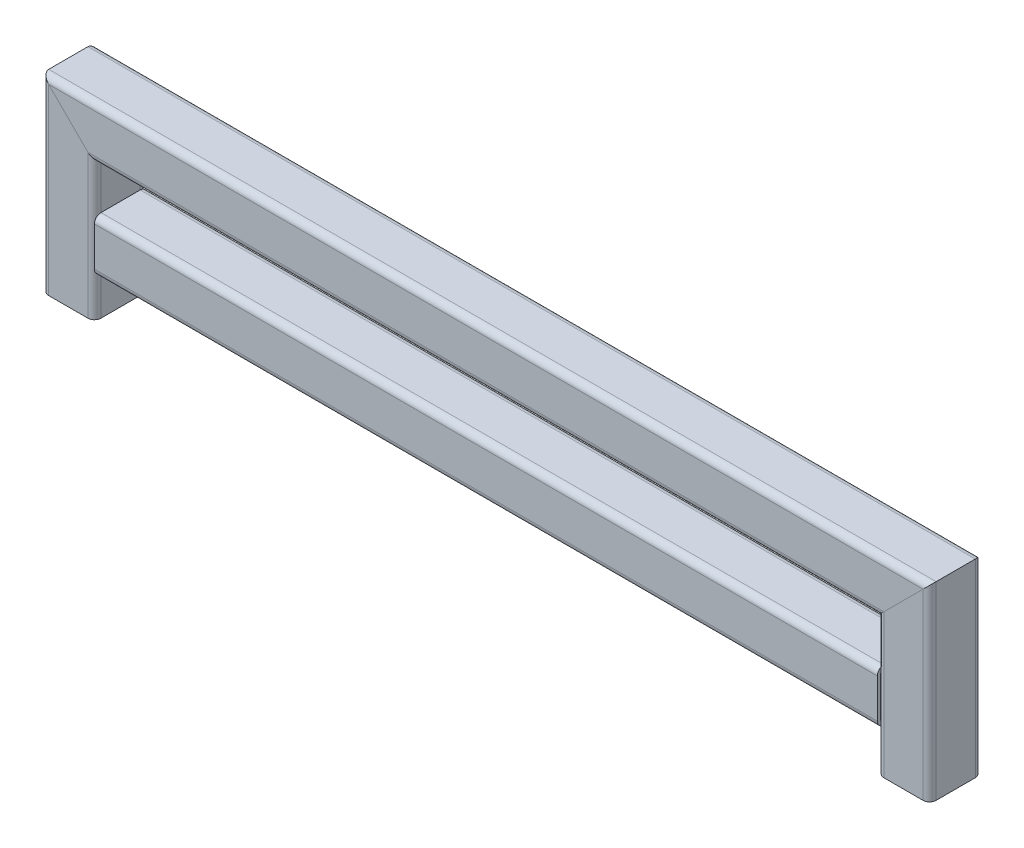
ISO-10303-21;
HEADER;
FILE_DESCRIPTION(('STEP AP214'),'2;1');
FILE_NAME('part.step','',(''),(''),'','','');
FILE_SCHEMA(('AUTOMOTIVE_DESIGN { 1 0 10303 214 1 1 1 1 }'));
ENDSEC;
DATA;
#1=APPLICATION_CONTEXT('core data for automotive mechanical design processes');
#2=APPLICATION_PROTOCOL_DEFINITION('international standard','automotive_design',2000,#1);
#3=PRODUCT_CONTEXT('',#1,'mechanical');
#4=PRODUCT('Part','Part','',(#3));
#5=PRODUCT_RELATED_PRODUCT_CATEGORY('part','',(#4));
#6=PRODUCT_DEFINITION_FORMATION('','',#4);
#7=PRODUCT_DEFINITION_CONTEXT('part definition',#1,'design');
#8=PRODUCT_DEFINITION('design','',#6,#7);
#9=PRODUCT_DEFINITION_SHAPE('','',#8);
#10=(LENGTH_UNIT() NAMED_UNIT(*) SI_UNIT(.MILLI.,.METRE.));
#11=(NAMED_UNIT(*) PLANE_ANGLE_UNIT() SI_UNIT($,.RADIAN.));
#12=(NAMED_UNIT(*) SI_UNIT($,.STERADIAN.) SOLID_ANGLE_UNIT());
#13=UNCERTAINTY_MEASURE_WITH_UNIT(LENGTH_MEASURE(1.E-05),#10,'distance_accuracy_value','');
#14=(GEOMETRIC_REPRESENTATION_CONTEXT(3) GLOBAL_UNCERTAINTY_ASSIGNED_CONTEXT((#13)) GLOBAL_UNIT_ASSIGNED_CONTEXT((#10,
#11,#12)) REPRESENTATION_CONTEXT('',''));
#15=CARTESIAN_POINT('',(0.,0.,0.));
#16=DIRECTION('',(0.,0.,1.));
#17=DIRECTION('',(1.,0.,0.));
#18=AXIS2_PLACEMENT_3D('',#15,#16,#17);
#19=CARTESIAN_POINT('',(1278.5,65.,-30.));
#20=DIRECTION('',(0.,1.,0.));
#21=DIRECTION('',(-1.,0.,0.));
#22=AXIS2_PLACEMENT_3D('',#19,#20,#21);
#23=PLANE('',#22);
#24=DIRECTION('',(-1.,0.,0.));
#25=VECTOR('',#24,1.);
#26=CARTESIAN_POINT('',(1278.5,65.,30.));
#27=LINE('',#26,#25);
#28=CARTESIAN_POINT('',(1238.5,65.,30.));
#29=VERTEX_POINT('',#28);
#30=CARTESIAN_POINT('',(40.,65.,30.));
#31=VERTEX_POINT('',#30);
#32=EDGE_CURVE('E174',#29,#31,#27,.T.);
#33=ORIENTED_EDGE('',*,*,#32,.F.);
#34=DIRECTION('',(0.,0.,-1.));
#35=VECTOR('',#34,1.);
#36=CARTESIAN_POINT('',(1238.5,65.,-30.));
#37=LINE('',#36,#35);
#38=CARTESIAN_POINT('',(1238.5,65.,-30.));
#39=VERTEX_POINT('',#38);
#40=EDGE_CURVE('E160',#29,#39,#37,.T.);
#41=ORIENTED_EDGE('',*,*,#40,.T.);
#42=DIRECTION('',(-1.,0.,0.));
#43=VECTOR('',#42,1.);
#44=CARTESIAN_POINT('',(1278.5,65.,-30.));
#45=LINE('',#44,#43);
#46=CARTESIAN_POINT('',(40.,65.,-30.));
#47=VERTEX_POINT('',#46);
#48=EDGE_CURVE('E51',#39,#47,#45,.T.);
#49=ORIENTED_EDGE('',*,*,#48,.T.);
#50=DIRECTION('',(0.,0.,1.));
#51=VECTOR('',#50,1.);
#52=CARTESIAN_POINT('',(40.,65.,-30.));
#53=LINE('',#52,#51);
#54=EDGE_CURVE('E168',#47,#31,#53,.T.);
#55=ORIENTED_EDGE('',*,*,#54,.T.);
#56=EDGE_LOOP('',(#33,#41,#49,#55));
#57=FACE_BOUND('',#56,.T.);
#58=ADVANCED_FACE('F47',(#57),#23,.T.);
#59=CARTESIAN_POINT('',(1278.5,70.,-30.));
#60=DIRECTION('',(-1.,0.,0.));
#61=DIRECTION('',(0.,-1.,0.));
#62=AXIS2_PLACEMENT_3D('',#59,#60,#61);
#63=CYLINDRICAL_SURFACE('',#62,4.99999999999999);
#64=ORIENTED_EDGE('',*,*,#48,.F.);
#65=CARTESIAN_POINT('',(1238.5,70.,-30.));
#66=DIRECTION('',(1.,0.,0.));
#67=DIRECTION('',(0.,0.,-1.));
#68=AXIS2_PLACEMENT_3D('',#65,#66,#67);
#69=CIRCLE('',#68,4.99999999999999);
#70=CARTESIAN_POINT('',(1238.5,70.,-35.));
#71=VERTEX_POINT('',#70);
#72=EDGE_CURVE('E157',#39,#71,#69,.T.);
#73=ORIENTED_EDGE('',*,*,#72,.T.);
#74=DIRECTION('',(-1.,0.,0.));
#75=VECTOR('',#74,1.);
#76=CARTESIAN_POINT('',(1278.5,70.,-35.));
#77=LINE('',#76,#75);
#78=CARTESIAN_POINT('',(40.,70.,-35.));
#79=VERTEX_POINT('',#78);
#80=EDGE_CURVE('E167',#71,#79,#77,.T.);
#81=ORIENTED_EDGE('',*,*,#80,.T.);
#82=CARTESIAN_POINT('',(40.,70.,-30.));
#83=DIRECTION('',(-1.,0.,0.));
#84=DIRECTION('',(0.,0.,1.));
#85=AXIS2_PLACEMENT_3D('',#82,#83,#84);
#86=CIRCLE('',#85,4.99999999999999);
#87=EDGE_CURVE('E179',#79,#47,#86,.T.);
#88=ORIENTED_EDGE('',*,*,#87,.T.);
#89=EDGE_LOOP('',(#64,#73,#81,#88));
#90=FACE_BOUND('',#89,.T.);
#91=ADVANCED_FACE('F177',(#90),#63,.F.);
#92=CARTESIAN_POINT('',(1278.5,70.,-35.));
#93=DIRECTION('',(0.,0.,1.));
#94=DIRECTION('',(1.,0.,0.));
#95=AXIS2_PLACEMENT_3D('',#92,#93,#94);
#96=PLANE('',#95);
#97=ORIENTED_EDGE('',*,*,#80,.F.);
#98=DIRECTION('',(0.,1.,0.));
#99=VECTOR('',#98,1.);
#100=CARTESIAN_POINT('',(1238.5,70.,-35.));
#101=LINE('',#100,#99);
#102=CARTESIAN_POINT('',(1238.5,130.,-35.));
#103=VERTEX_POINT('',#102);
#104=EDGE_CURVE('E163',#71,#103,#101,.T.);
#105=ORIENTED_EDGE('',*,*,#104,.T.);
#106=DIRECTION('',(-1.,0.,0.));
#107=VECTOR('',#106,1.);
#108=CARTESIAN_POINT('',(1278.5,130.,-35.));
#109=LINE('',#108,#107);
#110=CARTESIAN_POINT('',(40.,130.,-35.));
#111=VERTEX_POINT('',#110);
#112=EDGE_CURVE('E190',#103,#111,#109,.T.);
#113=ORIENTED_EDGE('',*,*,#112,.T.);
#114=DIRECTION('',(0.,-1.,0.));
#115=VECTOR('',#114,1.);
#116=CARTESIAN_POINT('',(40.,70.,-35.));
#117=LINE('',#116,#115);
#118=EDGE_CURVE('E186',#111,#79,#117,.T.);
#119=ORIENTED_EDGE('',*,*,#118,.T.);
#120=EDGE_LOOP('',(#97,#105,#113,#119));
#121=FACE_BOUND('',#120,.T.);
#122=ADVANCED_FACE('F278',(#121),#96,.T.);
#123=CARTESIAN_POINT('',(1278.5,130.,-30.));
#124=DIRECTION('',(-1.,0.,0.));
#125=DIRECTION('',(0.,-1.,0.));
#126=AXIS2_PLACEMENT_3D('',#123,#124,#125);
#127=CYLINDRICAL_SURFACE('',#126,5.);
#128=ORIENTED_EDGE('',*,*,#112,.F.);
#129=CARTESIAN_POINT('',(1238.5,130.,-30.));
#130=DIRECTION('',(1.,0.,0.));
#131=DIRECTION('',(0.,0.,-1.));
#132=AXIS2_PLACEMENT_3D('',#129,#130,#131);
#133=CIRCLE('',#132,5.);
#134=CARTESIAN_POINT('',(1238.5,135.,-30.));
#135=VERTEX_POINT('',#134);
#136=EDGE_CURVE('E189',#103,#135,#133,.T.);
#137=ORIENTED_EDGE('',*,*,#136,.T.);
#138=DIRECTION('',(-1.,0.,0.));
#139=VECTOR('',#138,1.);
#140=CARTESIAN_POINT('',(1278.5,135.,-30.));
#141=LINE('',#140,#139);
#142=CARTESIAN_POINT('',(40.,135.,-30.));
#143=VERTEX_POINT('',#142);
#144=EDGE_CURVE('E195',#135,#143,#141,.T.);
#145=ORIENTED_EDGE('',*,*,#144,.T.);
#146=CARTESIAN_POINT('',(40.,130.,-30.));
#147=DIRECTION('',(-1.,0.,0.));
#148=DIRECTION('',(0.,0.,1.));
#149=AXIS2_PLACEMENT_3D('',#146,#147,#148);
#150=CIRCLE('',#149,5.);
#151=EDGE_CURVE('E191',#143,#111,#150,.T.);
#152=ORIENTED_EDGE('',*,*,#151,.T.);
#153=EDGE_LOOP('',(#128,#137,#145,#152));
#154=FACE_BOUND('',#153,.T.);
#155=ADVANCED_FACE('F281',(#154),#127,.F.);
#156=CARTESIAN_POINT('',(1278.5,135.,30.));
#157=DIRECTION('',(0.,-1.,0.));
#158=DIRECTION('',(1.,0.,0.));
#159=AXIS2_PLACEMENT_3D('',#156,#157,#158);
#160=PLANE('',#159);
#161=ORIENTED_EDGE('',*,*,#144,.F.);
#162=DIRECTION('',(0.,0.,1.));
#163=VECTOR('',#162,1.);
#164=CARTESIAN_POINT('',(1238.5,135.,30.));
#165=LINE('',#164,#163);
#166=CARTESIAN_POINT('',(1238.5,135.,30.));
#167=VERTEX_POINT('',#166);
#168=EDGE_CURVE('E194',#135,#167,#165,.T.);
#169=ORIENTED_EDGE('',*,*,#168,.T.);
#170=DIRECTION('',(-1.,0.,0.));
#171=VECTOR('',#170,1.);
#172=CARTESIAN_POINT('',(1278.5,135.,30.));
#173=LINE('',#172,#171);
#174=CARTESIAN_POINT('',(40.,135.,30.));
#175=VERTEX_POINT('',#174);
#176=EDGE_CURVE('E200',#167,#175,#173,.T.);
#177=ORIENTED_EDGE('',*,*,#176,.T.);
#178=DIRECTION('',(0.,0.,-1.));
#179=VECTOR('',#178,1.);
#180=CARTESIAN_POINT('',(40.,135.,30.));
#181=LINE('',#180,#179);
#182=EDGE_CURVE('E196',#175,#143,#181,.T.);
#183=ORIENTED_EDGE('',*,*,#182,.T.);
#184=EDGE_LOOP('',(#161,#169,#177,#183));
#185=FACE_BOUND('',#184,.T.);
#186=ADVANCED_FACE('F286',(#185),#160,.T.);
#187=CARTESIAN_POINT('',(1278.5,130.,30.));
#188=DIRECTION('',(-1.,0.,0.));
#189=DIRECTION('',(0.,-1.,0.));
#190=AXIS2_PLACEMENT_3D('',#187,#188,#189);
#191=CYLINDRICAL_SURFACE('',#190,5.);
#192=ORIENTED_EDGE('',*,*,#176,.F.);
#193=CARTESIAN_POINT('',(1238.5,130.,30.));
#194=DIRECTION('',(1.,0.,0.));
#195=DIRECTION('',(0.,0.,-1.));
#196=AXIS2_PLACEMENT_3D('',#193,#194,#195);
#197=CIRCLE('',#196,5.);
#198=CARTESIAN_POINT('',(1238.5,130.,35.));
#199=VERTEX_POINT('',#198);
#200=EDGE_CURVE('E199',#167,#199,#197,.T.);
#201=ORIENTED_EDGE('',*,*,#200,.T.);
#202=DIRECTION('',(-1.,0.,0.));
#203=VECTOR('',#202,1.);
#204=CARTESIAN_POINT('',(1278.5,130.,35.));
#205=LINE('',#204,#203);
#206=CARTESIAN_POINT('',(40.,130.,35.));
#207=VERTEX_POINT('',#206);
#208=EDGE_CURVE('E205',#199,#207,#205,.T.);
#209=ORIENTED_EDGE('',*,*,#208,.T.);
#210=CARTESIAN_POINT('',(40.,130.,30.));
#211=DIRECTION('',(-1.,0.,0.));
#212=DIRECTION('',(0.,0.,1.));
#213=AXIS2_PLACEMENT_3D('',#210,#211,#212);
#214=CIRCLE('',#213,5.);
#215=EDGE_CURVE('E201',#207,#175,#214,.T.);
#216=ORIENTED_EDGE('',*,*,#215,.T.);
#217=EDGE_LOOP('',(#192,#201,#209,#216));
#218=FACE_BOUND('',#217,.T.);
#219=ADVANCED_FACE('F289',(#218),#191,.F.);
#220=CARTESIAN_POINT('',(1278.5,130.,35.));
#221=DIRECTION('',(0.,0.,-1.));
#222=DIRECTION('',(-1.,0.,0.));
#223=AXIS2_PLACEMENT_3D('',#220,#221,#222);
#224=PLANE('',#223);
#225=ORIENTED_EDGE('',*,*,#208,.F.);
#226=DIRECTION('',(0.,-1.,0.));
#227=VECTOR('',#226,1.);
#228=CARTESIAN_POINT('',(1238.5,130.,35.));
#229=LINE('',#228,#227);
#230=CARTESIAN_POINT('',(1238.5,69.9999999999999,35.));
#231=VERTEX_POINT('',#230);
#232=EDGE_CURVE('E204',#199,#231,#229,.T.);
#233=ORIENTED_EDGE('',*,*,#232,.T.);
#234=DIRECTION('',(-1.,0.,0.));
#235=VECTOR('',#234,1.);
#236=CARTESIAN_POINT('',(1278.5,70.,35.));
#237=LINE('',#236,#235);
#238=CARTESIAN_POINT('',(40.,69.9999999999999,35.));
#239=VERTEX_POINT('',#238);
#240=EDGE_CURVE('E210',#231,#239,#237,.T.);
#241=ORIENTED_EDGE('',*,*,#240,.T.);
#242=DIRECTION('',(0.,1.,0.));
#243=VECTOR('',#242,1.);
#244=CARTESIAN_POINT('',(40.,130.,35.));
#245=LINE('',#244,#243);
#246=EDGE_CURVE('E206',#239,#207,#245,.T.);
#247=ORIENTED_EDGE('',*,*,#246,.T.);
#248=EDGE_LOOP('',(#225,#233,#241,#247));
#249=FACE_BOUND('',#248,.T.);
#250=ADVANCED_FACE('F293',(#249),#224,.T.);
#251=CARTESIAN_POINT('',(1278.5,70.,30.));
#252=DIRECTION('',(-1.,0.,0.));
#253=DIRECTION('',(0.,-1.,0.));
#254=AXIS2_PLACEMENT_3D('',#251,#252,#253);
#255=CYLINDRICAL_SURFACE('',#254,5.);
#256=ORIENTED_EDGE('',*,*,#240,.F.);
#257=CARTESIAN_POINT('',(1238.5,70.,30.));
#258=DIRECTION('',(1.,0.,0.));
#259=DIRECTION('',(0.,0.,-1.));
#260=AXIS2_PLACEMENT_3D('',#257,#258,#259);
#261=CIRCLE('',#260,5.);
#262=EDGE_CURVE('E209',#231,#29,#261,.T.);
#263=ORIENTED_EDGE('',*,*,#262,.T.);
#264=ORIENTED_EDGE('',*,*,#32,.T.);
#265=CARTESIAN_POINT('',(40.,70.,30.));
#266=DIRECTION('',(-1.,0.,0.));
#267=DIRECTION('',(0.,0.,1.));
#268=AXIS2_PLACEMENT_3D('',#265,#266,#267);
#269=CIRCLE('',#268,5.);
#270=EDGE_CURVE('E211',#31,#239,#269,.T.);
#271=ORIENTED_EDGE('',*,*,#270,.T.);
#272=EDGE_LOOP('',(#256,#263,#264,#271));
#273=FACE_BOUND('',#272,.T.);
#274=ADVANCED_FACE('F296',(#273),#255,.F.);
#275=CARTESIAN_POINT('',(40.,250.,-30.));
#276=DIRECTION('',(-1.,0.,0.));
#277=DIRECTION('',(0.,0.,1.));
#278=AXIS2_PLACEMENT_3D('',#275,#276,#277);
#279=PLANE('',#278);
#280=ORIENTED_EDGE('',*,*,#54,.F.);
#281=ORIENTED_EDGE('',*,*,#87,.F.);
#282=ORIENTED_EDGE('',*,*,#118,.F.);
#283=ORIENTED_EDGE('',*,*,#151,.F.);
#284=ORIENTED_EDGE('',*,*,#182,.F.);
#285=ORIENTED_EDGE('',*,*,#215,.F.);
#286=ORIENTED_EDGE('',*,*,#246,.F.);
#287=ORIENTED_EDGE('',*,*,#270,.F.);
#288=EDGE_LOOP('',(#280,#281,#282,#283,#284,#285,#286,#287));
#289=FACE_BOUND('',#288,.T.);
#290=CARTESIAN_POINT('',(40.,70.,30.));
#291=DIRECTION('',(-1.,0.,0.));
#292=DIRECTION('',(0.,0.,1.));
#293=AXIS2_PLACEMENT_3D('',#290,#291,#292);
#294=CIRCLE('',#293,10.);
#295=CARTESIAN_POINT('',(40.,60.,30.));
#296=VERTEX_POINT('',#295);
#297=CARTESIAN_POINT('',(40.,70.,40.));
#298=VERTEX_POINT('',#297);
#299=EDGE_CURVE('E214',#296,#298,#294,.T.);
#300=ORIENTED_EDGE('',*,*,#299,.T.);
#301=DIRECTION('',(0.,-1.,0.));
#302=VECTOR('',#301,1.);
#303=CARTESIAN_POINT('',(40.,521.287648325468,40.));
#304=LINE('',#303,#302);
#305=CARTESIAN_POINT('',(40.,130.,40.));
#306=VERTEX_POINT('',#305);
#307=EDGE_CURVE('E254',#306,#298,#304,.T.);
#308=ORIENTED_EDGE('',*,*,#307,.F.);
#309=CARTESIAN_POINT('',(40.,130.,30.));
#310=DIRECTION('',(-1.,0.,0.));
#311=DIRECTION('',(0.,0.,1.));
#312=AXIS2_PLACEMENT_3D('',#309,#310,#311);
#313=CIRCLE('',#312,10.);
#314=CARTESIAN_POINT('',(40.,140.,30.));
#315=VERTEX_POINT('',#314);
#316=EDGE_CURVE('E183',#306,#315,#313,.T.);
#317=ORIENTED_EDGE('',*,*,#316,.T.);
#318=DIRECTION('',(0.,0.,-1.));
#319=VECTOR('',#318,1.);
#320=CARTESIAN_POINT('',(40.,140.,30.));
#321=LINE('',#320,#319);
#322=CARTESIAN_POINT('',(40.,140.,-30.));
#323=VERTEX_POINT('',#322);
#324=EDGE_CURVE('E225',#315,#323,#321,.T.);
#325=ORIENTED_EDGE('',*,*,#324,.T.);
#326=CARTESIAN_POINT('',(40.,130.,-30.));
#327=DIRECTION('',(-1.,0.,0.));
#328=DIRECTION('',(0.,0.,1.));
#329=AXIS2_PLACEMENT_3D('',#326,#327,#328);
#330=CIRCLE('',#329,10.);
#331=CARTESIAN_POINT('',(40.,130.,-40.));
#332=VERTEX_POINT('',#331);
#333=EDGE_CURVE('E228',#323,#332,#330,.T.);
#334=ORIENTED_EDGE('',*,*,#333,.T.);
#335=DIRECTION('',(0.,-1.,0.));
#336=VECTOR('',#335,1.);
#337=CARTESIAN_POINT('',(40.,521.287648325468,-40.));
#338=LINE('',#337,#336);
#339=CARTESIAN_POINT('',(40.,69.9999999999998,-40.));
#340=VERTEX_POINT('',#339);
#341=EDGE_CURVE('E219',#332,#340,#338,.T.);
#342=ORIENTED_EDGE('',*,*,#341,.T.);
#343=CARTESIAN_POINT('',(40.,70.,-30.));
#344=DIRECTION('',(-1.,0.,0.));
#345=DIRECTION('',(0.,0.,1.));
#346=AXIS2_PLACEMENT_3D('',#343,#344,#345);
#347=CIRCLE('',#346,10.);
#348=CARTESIAN_POINT('',(40.,60.,-30.));
#349=VERTEX_POINT('',#348);
#350=EDGE_CURVE('E215',#340,#349,#347,.T.);
#351=ORIENTED_EDGE('',*,*,#350,.T.);
#352=DIRECTION('',(0.,0.,1.));
#353=VECTOR('',#352,1.);
#354=CARTESIAN_POINT('',(40.,60.,-30.));
#355=LINE('',#354,#353);
#356=EDGE_CURVE('E218',#349,#296,#355,.T.);
#357=ORIENTED_EDGE('',*,*,#356,.T.);
#358=EDGE_LOOP('',(#300,#308,#317,#325,#334,#342,#351,#357));
#359=FACE_BOUND('',#358,.T.);
#360=ADVANCED_FACE('F274',(#289,#359),#279,.T.);
#361=CARTESIAN_POINT('',(1278.5,140.,30.));
#362=DIRECTION('',(0.,-1.,0.));
#363=DIRECTION('',(1.,0.,0.));
#364=AXIS2_PLACEMENT_3D('',#361,#362,#363);
#365=PLANE('',#364);
#366=DIRECTION('',(0.,0.,1.));
#367=VECTOR('',#366,1.);
#368=CARTESIAN_POINT('',(1238.5,140.,30.));
#369=LINE('',#368,#367);
#370=CARTESIAN_POINT('',(1238.5,140.,-30.));
#371=VERTEX_POINT('',#370);
#372=CARTESIAN_POINT('',(1238.5,140.,30.));
#373=VERTEX_POINT('',#372);
#374=EDGE_CURVE('E56',#371,#373,#369,.T.);
#375=ORIENTED_EDGE('',*,*,#374,.F.);
#376=DIRECTION('',(-1.,0.,0.));
#377=VECTOR('',#376,1.);
#378=CARTESIAN_POINT('',(1278.5,140.,-30.));
#379=LINE('',#378,#377);
#380=EDGE_CURVE('E222',#371,#323,#379,.T.);
#381=ORIENTED_EDGE('',*,*,#380,.T.);
#382=ORIENTED_EDGE('',*,*,#324,.F.);
#383=DIRECTION('',(-1.,0.,0.));
#384=VECTOR('',#383,1.);
#385=CARTESIAN_POINT('',(1278.5,140.,30.));
#386=LINE('',#385,#384);
#387=EDGE_CURVE('E232',#373,#315,#386,.T.);
#388=ORIENTED_EDGE('',*,*,#387,.F.);
#389=EDGE_LOOP('',(#375,#381,#382,#388));
#390=FACE_BOUND('',#389,.T.);
#391=ADVANCED_FACE('F303',(#390),#365,.F.);
#392=CARTESIAN_POINT('',(1278.5,130.,-30.));
#393=DIRECTION('',(-1.,0.,0.));
#394=DIRECTION('',(0.,-1.,0.));
#395=AXIS2_PLACEMENT_3D('',#392,#393,#394);
#396=CYLINDRICAL_SURFACE('',#395,10.);
#397=CARTESIAN_POINT('',(1238.5,130.,-30.));
#398=DIRECTION('',(1.,0.,0.));
#399=DIRECTION('',(0.,0.,-1.));
#400=AXIS2_PLACEMENT_3D('',#397,#398,#399);
#401=CIRCLE('',#400,10.);
#402=CARTESIAN_POINT('',(1238.5,130.,-40.));
#403=VERTEX_POINT('',#402);
#404=EDGE_CURVE('E247',#403,#371,#401,.T.);
#405=ORIENTED_EDGE('',*,*,#404,.F.);
#406=DIRECTION('',(-1.,0.,0.));
#407=VECTOR('',#406,1.);
#408=CARTESIAN_POINT('',(1278.5,130.,-40.));
#409=LINE('',#408,#407);
#410=EDGE_CURVE('E263',#403,#332,#409,.T.);
#411=ORIENTED_EDGE('',*,*,#410,.T.);
#412=ORIENTED_EDGE('',*,*,#333,.F.);
#413=ORIENTED_EDGE('',*,*,#380,.F.);
#414=EDGE_LOOP('',(#405,#411,#412,#413));
#415=FACE_BOUND('',#414,.T.);
#416=ADVANCED_FACE('F352',(#415),#396,.T.);
#417=CARTESIAN_POINT('',(1278.5,70.,-40.));
#418=DIRECTION('',(0.,0.,1.));
#419=DIRECTION('',(1.,0.,0.));
#420=AXIS2_PLACEMENT_3D('',#417,#418,#419);
#421=PLANE('',#420);
#422=DIRECTION('',(0.,1.,0.));
#423=VECTOR('',#422,1.);
#424=CARTESIAN_POINT('',(1238.5,-311.287648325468,-40.));
#425=LINE('',#424,#423);
#426=CARTESIAN_POINT('',(1238.5,69.9999999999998,-40.));
#427=VERTEX_POINT('',#426);
#428=EDGE_CURVE('E236',#427,#403,#425,.T.);
#429=ORIENTED_EDGE('',*,*,#428,.F.);
#430=DIRECTION('',(-1.,0.,0.));
#431=VECTOR('',#430,1.);
#432=CARTESIAN_POINT('',(1278.5,70.,-40.));
#433=LINE('',#432,#431);
#434=EDGE_CURVE('E261',#427,#340,#433,.T.);
#435=ORIENTED_EDGE('',*,*,#434,.T.);
#436=ORIENTED_EDGE('',*,*,#341,.F.);
#437=ORIENTED_EDGE('',*,*,#410,.F.);
#438=EDGE_LOOP('',(#429,#435,#436,#437));
#439=FACE_BOUND('',#438,.T.);
#440=ADVANCED_FACE('F362',(#439),#421,.F.);
#441=CARTESIAN_POINT('',(1278.5,70.,-30.));
#442=DIRECTION('',(-1.,0.,0.));
#443=DIRECTION('',(0.,-1.,0.));
#444=AXIS2_PLACEMENT_3D('',#441,#442,#443);
#445=CYLINDRICAL_SURFACE('',#444,10.);
#446=CARTESIAN_POINT('',(1238.5,70.,-30.));
#447=DIRECTION('',(1.,0.,0.));
#448=DIRECTION('',(0.,0.,-1.));
#449=AXIS2_PLACEMENT_3D('',#446,#447,#448);
#450=CIRCLE('',#449,10.);
#451=CARTESIAN_POINT('',(1238.5,60.,-30.));
#452=VERTEX_POINT('',#451);
#453=EDGE_CURVE('E234',#452,#427,#450,.T.);
#454=ORIENTED_EDGE('',*,*,#453,.F.);
#455=DIRECTION('',(-1.,0.,0.));
#456=VECTOR('',#455,1.);
#457=CARTESIAN_POINT('',(1278.5,60.,-30.));
#458=LINE('',#457,#456);
#459=EDGE_CURVE('E259',#452,#349,#458,.T.);
#460=ORIENTED_EDGE('',*,*,#459,.T.);
#461=ORIENTED_EDGE('',*,*,#350,.F.);
#462=ORIENTED_EDGE('',*,*,#434,.F.);
#463=EDGE_LOOP('',(#454,#460,#461,#462));
#464=FACE_BOUND('',#463,.T.);
#465=ADVANCED_FACE('F373',(#464),#445,.T.);
#466=CARTESIAN_POINT('',(1278.5,60.,-30.));
#467=DIRECTION('',(0.,1.,0.));
#468=DIRECTION('',(-1.,0.,0.));
#469=AXIS2_PLACEMENT_3D('',#466,#467,#468);
#470=PLANE('',#469);
#471=DIRECTION('',(0.,0.,-1.));
#472=VECTOR('',#471,1.);
#473=CARTESIAN_POINT('',(1238.5,60.,-30.));
#474=LINE('',#473,#472);
#475=CARTESIAN_POINT('',(1238.5,60.,30.));
#476=VERTEX_POINT('',#475);
#477=EDGE_CURVE('E231',#476,#452,#474,.T.);
#478=ORIENTED_EDGE('',*,*,#477,.F.);
#479=DIRECTION('',(-1.,0.,0.));
#480=VECTOR('',#479,1.);
#481=CARTESIAN_POINT('',(1278.5,60.,30.));
#482=LINE('',#481,#480);
#483=EDGE_CURVE('E257',#476,#296,#482,.T.);
#484=ORIENTED_EDGE('',*,*,#483,.T.);
#485=ORIENTED_EDGE('',*,*,#356,.F.);
#486=ORIENTED_EDGE('',*,*,#459,.F.);
#487=EDGE_LOOP('',(#478,#484,#485,#486));
#488=FACE_BOUND('',#487,.T.);
#489=ADVANCED_FACE('F384',(#488),#470,.F.);
#490=CARTESIAN_POINT('',(1278.5,70.,30.));
#491=DIRECTION('',(-1.,0.,0.));
#492=DIRECTION('',(0.,-1.,0.));
#493=AXIS2_PLACEMENT_3D('',#490,#491,#492);
#494=CYLINDRICAL_SURFACE('',#493,10.);
#495=CARTESIAN_POINT('',(1238.5,70.,30.));
#496=DIRECTION('',(1.,0.,0.));
#497=DIRECTION('',(0.,0.,-1.));
#498=AXIS2_PLACEMENT_3D('',#495,#496,#497);
#499=CIRCLE('',#498,10.);
#500=CARTESIAN_POINT('',(1238.5,70.,40.));
#501=VERTEX_POINT('',#500);
#502=EDGE_CURVE('E229',#501,#476,#499,.T.);
#503=ORIENTED_EDGE('',*,*,#502,.F.);
#504=DIRECTION('',(-1.,0.,0.));
#505=VECTOR('',#504,1.);
#506=CARTESIAN_POINT('',(1278.5,70.,40.));
#507=LINE('',#506,#505);
#508=EDGE_CURVE('E251',#501,#298,#507,.T.);
#509=ORIENTED_EDGE('',*,*,#508,.T.);
#510=ORIENTED_EDGE('',*,*,#299,.F.);
#511=ORIENTED_EDGE('',*,*,#483,.F.);
#512=EDGE_LOOP('',(#503,#509,#510,#511));
#513=FACE_BOUND('',#512,.T.);
#514=ADVANCED_FACE('F395',(#513),#494,.T.);
#515=CARTESIAN_POINT('',(1278.5,130.,40.));
#516=DIRECTION('',(0.,0.,-1.));
#517=DIRECTION('',(-1.,0.,0.));
#518=AXIS2_PLACEMENT_3D('',#515,#516,#517);
#519=PLANE('',#518);
#520=DIRECTION('',(0.,1.,0.));
#521=VECTOR('',#520,1.);
#522=CARTESIAN_POINT('',(1238.5,-311.287648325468,40.));
#523=LINE('',#522,#521);
#524=CARTESIAN_POINT('',(1238.5,130.,40.));
#525=VERTEX_POINT('',#524);
#526=EDGE_CURVE('E63',#501,#525,#523,.T.);
#527=ORIENTED_EDGE('',*,*,#526,.T.);
#528=DIRECTION('',(-1.,0.,0.));
#529=VECTOR('',#528,1.);
#530=CARTESIAN_POINT('',(1278.5,130.,40.));
#531=LINE('',#530,#529);
#532=EDGE_CURVE('E250',#525,#306,#531,.T.);
#533=ORIENTED_EDGE('',*,*,#532,.T.);
#534=ORIENTED_EDGE('',*,*,#307,.T.);
#535=ORIENTED_EDGE('',*,*,#508,.F.);
#536=EDGE_LOOP('',(#527,#533,#534,#535));
#537=FACE_BOUND('',#536,.T.);
#538=ADVANCED_FACE('F406',(#537),#519,.F.);
#539=CARTESIAN_POINT('',(1278.5,130.,30.));
#540=DIRECTION('',(-1.,0.,0.));
#541=DIRECTION('',(0.,-1.,0.));
#542=AXIS2_PLACEMENT_3D('',#539,#540,#541);
#543=CYLINDRICAL_SURFACE('',#542,10.);
#544=CARTESIAN_POINT('',(1238.5,130.,30.));
#545=DIRECTION('',(1.,0.,0.));
#546=DIRECTION('',(0.,0.,-1.));
#547=AXIS2_PLACEMENT_3D('',#544,#545,#546);
#548=CIRCLE('',#547,10.);
#549=EDGE_CURVE('E12',#373,#525,#548,.T.);
#550=ORIENTED_EDGE('',*,*,#549,.F.);
#551=ORIENTED_EDGE('',*,*,#387,.T.);
#552=ORIENTED_EDGE('',*,*,#316,.F.);
#553=ORIENTED_EDGE('',*,*,#532,.F.);
#554=EDGE_LOOP('',(#550,#551,#552,#553));
#555=FACE_BOUND('',#554,.T.);
#556=ADVANCED_FACE('F49',(#555),#543,.T.);
#557=CARTESIAN_POINT('',(1238.5,0.,-30.));
#558=DIRECTION('',(1.,0.,0.));
#559=DIRECTION('',(0.,0.,-1.));
#560=AXIS2_PLACEMENT_3D('',#557,#558,#559);
#561=PLANE('',#560);
#562=ORIENTED_EDGE('',*,*,#232,.F.);
#563=ORIENTED_EDGE('',*,*,#200,.F.);
#564=ORIENTED_EDGE('',*,*,#168,.F.);
#565=ORIENTED_EDGE('',*,*,#136,.F.);
#566=ORIENTED_EDGE('',*,*,#104,.F.);
#567=ORIENTED_EDGE('',*,*,#72,.F.);
#568=ORIENTED_EDGE('',*,*,#40,.F.);
#569=ORIENTED_EDGE('',*,*,#262,.F.);
#570=EDGE_LOOP('',(#562,#563,#564,#565,#566,#567,#568,#569));
#571=FACE_BOUND('',#570,.T.);
#572=ORIENTED_EDGE('',*,*,#502,.T.);
#573=ORIENTED_EDGE('',*,*,#477,.T.);
#574=ORIENTED_EDGE('',*,*,#453,.T.);
#575=ORIENTED_EDGE('',*,*,#428,.T.);
#576=ORIENTED_EDGE('',*,*,#404,.T.);
#577=ORIENTED_EDGE('',*,*,#374,.T.);
#578=ORIENTED_EDGE('',*,*,#549,.T.);
#579=ORIENTED_EDGE('',*,*,#526,.F.);
#580=EDGE_LOOP('',(#572,#573,#574,#575,#576,#577,#578,#579));
#581=FACE_BOUND('',#580,.T.);
#582=ADVANCED_FACE('F159',(#571,#581),#561,.T.);
#583=CLOSED_SHELL('',(#58,#91,#122,#155,#186,#219,#250,#274,#360,#391,#416,#440,#465,#489,#514,
#538,#556,#582));
#584=MANIFOLD_SOLID_BREP('B2',#583);
#585=CARTESIAN_POINT('',(1278.5,215.,-30.));
#586=DIRECTION('',(0.,1.,0.));
#587=DIRECTION('',(0.,0.,1.));
#588=AXIS2_PLACEMENT_3D('',#585,#586,#587);
#589=PLANE('',#588);
#590=DIRECTION('',(-1.,0.,0.));
#591=VECTOR('',#590,1.);
#592=CARTESIAN_POINT('',(1278.5,215.,30.));
#593=LINE('',#592,#591);
#594=CARTESIAN_POINT('',(1243.5,215.,30.));
#595=VERTEX_POINT('',#594);
#596=CARTESIAN_POINT('',(34.9999999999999,215.,30.));
#597=VERTEX_POINT('',#596);
#598=EDGE_CURVE('E549',#595,#597,#593,.T.);
#599=ORIENTED_EDGE('',*,*,#598,.F.);
#600=DIRECTION('',(0.,0.,-1.));
#601=VECTOR('',#600,1.);
#602=CARTESIAN_POINT('',(1243.5,215.,-30.));
#603=LINE('',#602,#601);
#604=CARTESIAN_POINT('',(1243.5,215.,-30.));
#605=VERTEX_POINT('',#604);
#606=EDGE_CURVE('E590',#595,#605,#603,.T.);
#607=ORIENTED_EDGE('',*,*,#606,.T.);
#608=DIRECTION('',(-1.,0.,0.));
#609=VECTOR('',#608,1.);
#610=CARTESIAN_POINT('',(1278.5,215.,-30.));
#611=LINE('',#610,#609);
#612=CARTESIAN_POINT('',(34.9999999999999,215.,-30.));
#613=VERTEX_POINT('',#612);
#614=EDGE_CURVE('E680',#605,#613,#611,.T.);
#615=ORIENTED_EDGE('',*,*,#614,.T.);
#616=DIRECTION('',(0.,0.,-1.));
#617=VECTOR('',#616,1.);
#618=CARTESIAN_POINT('',(34.9999999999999,215.,-30.));
#619=LINE('',#618,#617);
#620=EDGE_CURVE('E673',#597,#613,#619,.T.);
#621=ORIENTED_EDGE('',*,*,#620,.F.);
#622=EDGE_LOOP('',(#599,#607,#615,#621));
#623=FACE_BOUND('',#622,.T.);
#624=ADVANCED_FACE('F545',(#623),#589,.T.);
#625=CARTESIAN_POINT('',(1278.5,220.,-30.));
#626=DIRECTION('',(-1.,0.,0.));
#627=DIRECTION('',(0.,0.,1.));
#628=AXIS2_PLACEMENT_3D('',#625,#626,#627);
#629=CYLINDRICAL_SURFACE('',#628,4.99999999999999);
#630=ORIENTED_EDGE('',*,*,#614,.F.);
#631=CARTESIAN_POINT('',(1248.5,220.,-30.));
#632=DIRECTION('',(0.707106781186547,-0.707106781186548,0.));
#633=DIRECTION('',(-0.707106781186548,-0.707106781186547,0.));
#634=AXIS2_PLACEMENT_3D('',#631,#632,#633);
#635=ELLIPSE('',#634,7.07106781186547,4.99999999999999);
#636=CARTESIAN_POINT('',(1248.5,220.,-35.));
#637=VERTEX_POINT('',#636);
#638=EDGE_CURVE('E564',#605,#637,#635,.T.);
#639=ORIENTED_EDGE('',*,*,#638,.T.);
#640=DIRECTION('',(-1.,0.,0.));
#641=VECTOR('',#640,1.);
#642=CARTESIAN_POINT('',(1278.5,220.,-35.));
#643=LINE('',#642,#641);
#644=CARTESIAN_POINT('',(30.,220.,-35.));
#645=VERTEX_POINT('',#644);
#646=EDGE_CURVE('E736',#637,#645,#643,.T.);
#647=ORIENTED_EDGE('',*,*,#646,.T.);
#648=CARTESIAN_POINT('',(30.,220.,-30.));
#649=DIRECTION('',(0.707106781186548,0.707106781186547,0.));
#650=DIRECTION('',(-0.707106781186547,0.707106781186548,0.));
#651=AXIS2_PLACEMENT_3D('',#648,#649,#650);
#652=ELLIPSE('',#651,7.07106781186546,4.99999999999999);
#653=EDGE_CURVE('E681',#613,#645,#652,.T.);
#654=ORIENTED_EDGE('',*,*,#653,.F.);
#655=EDGE_LOOP('',(#630,#639,#647,#654));
#656=FACE_BOUND('',#655,.T.);
#657=ADVANCED_FACE('F774',(#656),#629,.F.);
#658=CARTESIAN_POINT('',(1278.5,220.,-35.));
#659=DIRECTION('',(0.,0.,1.));
#660=DIRECTION('',(1.,0.,0.));
#661=AXIS2_PLACEMENT_3D('',#658,#659,#660);
#662=PLANE('',#661);
#663=ORIENTED_EDGE('',*,*,#646,.F.);
#664=DIRECTION('',(0.707106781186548,0.707106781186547,0.));
#665=VECTOR('',#664,1.);
#666=CARTESIAN_POINT('',(1263.5,235.,-35.));
#667=LINE('',#666,#665);
#668=CARTESIAN_POINT('',(1308.5,280.,-35.));
#669=VERTEX_POINT('',#668);
#670=EDGE_CURVE('E737',#637,#669,#667,.T.);
#671=ORIENTED_EDGE('',*,*,#670,.T.);
#672=DIRECTION('',(-1.,0.,0.));
#673=VECTOR('',#672,1.);
#674=CARTESIAN_POINT('',(1278.5,280.,-35.));
#675=LINE('',#674,#673);
#676=CARTESIAN_POINT('',(-30.0000000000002,280.,-35.));
#677=VERTEX_POINT('',#676);
#678=EDGE_CURVE('E740',#669,#677,#675,.T.);
#679=ORIENTED_EDGE('',*,*,#678,.T.);
#680=DIRECTION('',(-0.707106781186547,0.707106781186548,0.));
#681=VECTOR('',#680,1.);
#682=CARTESIAN_POINT('',(654.25,-404.25,-35.));
#683=LINE('',#682,#681);
#684=EDGE_CURVE('E683',#645,#677,#683,.T.);
#685=ORIENTED_EDGE('',*,*,#684,.F.);
#686=EDGE_LOOP('',(#663,#671,#679,#685));
#687=FACE_BOUND('',#686,.T.);
#688=ADVANCED_FACE('F780',(#687),#662,.T.);
#689=CARTESIAN_POINT('',(1278.5,280.,-30.));
#690=DIRECTION('',(-1.,0.,0.));
#691=DIRECTION('',(0.,0.,1.));
#692=AXIS2_PLACEMENT_3D('',#689,#690,#691);
#693=CYLINDRICAL_SURFACE('',#692,5.);
#694=ORIENTED_EDGE('',*,*,#678,.F.);
#695=CARTESIAN_POINT('',(1308.5,280.,-30.));
#696=DIRECTION('',(0.707106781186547,-0.707106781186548,0.));
#697=DIRECTION('',(-0.707106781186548,-0.707106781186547,0.));
#698=AXIS2_PLACEMENT_3D('',#695,#696,#697);
#699=ELLIPSE('',#698,7.07106781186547,5.);
#700=CARTESIAN_POINT('',(1313.5,285.,-30.));
#701=VERTEX_POINT('',#700);
#702=EDGE_CURVE('E741',#669,#701,#699,.T.);
#703=ORIENTED_EDGE('',*,*,#702,.T.);
#704=DIRECTION('',(-1.,0.,0.));
#705=VECTOR('',#704,1.);
#706=CARTESIAN_POINT('',(1278.5,285.,-30.));
#707=LINE('',#706,#705);
#708=CARTESIAN_POINT('',(-34.9999999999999,285.,-30.));
#709=VERTEX_POINT('',#708);
#710=EDGE_CURVE('E744',#701,#709,#707,.T.);
#711=ORIENTED_EDGE('',*,*,#710,.T.);
#712=CARTESIAN_POINT('',(-30.,280.,-30.));
#713=DIRECTION('',(0.707106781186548,0.707106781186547,0.));
#714=DIRECTION('',(-0.707106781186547,0.707106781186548,0.));
#715=AXIS2_PLACEMENT_3D('',#712,#713,#714);
#716=ELLIPSE('',#715,7.07106781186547,5.);
#717=EDGE_CURVE('E782',#677,#709,#716,.T.);
#718=ORIENTED_EDGE('',*,*,#717,.F.);
#719=EDGE_LOOP('',(#694,#703,#711,#718));
#720=FACE_BOUND('',#719,.T.);
#721=ADVANCED_FACE('F842',(#720),#693,.F.);
#722=CARTESIAN_POINT('',(1278.5,285.,30.));
#723=DIRECTION('',(0.,-1.,0.));
#724=DIRECTION('',(0.,0.,-1.));
#725=AXIS2_PLACEMENT_3D('',#722,#723,#724);
#726=PLANE('',#725);
#727=ORIENTED_EDGE('',*,*,#710,.F.);
#728=DIRECTION('',(0.,0.,1.));
#729=VECTOR('',#728,1.);
#730=CARTESIAN_POINT('',(1313.5,285.,30.));
#731=LINE('',#730,#729);
#732=CARTESIAN_POINT('',(1313.5,285.,30.));
#733=VERTEX_POINT('',#732);
#734=EDGE_CURVE('E745',#701,#733,#731,.T.);
#735=ORIENTED_EDGE('',*,*,#734,.T.);
#736=DIRECTION('',(-1.,0.,0.));
#737=VECTOR('',#736,1.);
#738=CARTESIAN_POINT('',(1278.5,285.,30.));
#739=LINE('',#738,#737);
#740=CARTESIAN_POINT('',(-34.9999999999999,285.,30.));
#741=VERTEX_POINT('',#740);
#742=EDGE_CURVE('E748',#733,#741,#739,.T.);
#743=ORIENTED_EDGE('',*,*,#742,.T.);
#744=DIRECTION('',(0.,0.,1.));
#745=VECTOR('',#744,1.);
#746=CARTESIAN_POINT('',(-34.9999999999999,285.,30.));
#747=LINE('',#746,#745);
#748=EDGE_CURVE('E783',#709,#741,#747,.T.);
#749=ORIENTED_EDGE('',*,*,#748,.F.);
#750=EDGE_LOOP('',(#727,#735,#743,#749));
#751=FACE_BOUND('',#750,.T.);
#752=ADVANCED_FACE('F845',(#751),#726,.T.);
#753=CARTESIAN_POINT('',(1278.5,280.,30.));
#754=DIRECTION('',(-1.,0.,0.));
#755=DIRECTION('',(0.,0.,1.));
#756=AXIS2_PLACEMENT_3D('',#753,#754,#755);
#757=CYLINDRICAL_SURFACE('',#756,5.);
#758=ORIENTED_EDGE('',*,*,#742,.F.);
#759=CARTESIAN_POINT('',(1308.5,280.,30.));
#760=DIRECTION('',(0.707106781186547,-0.707106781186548,0.));
#761=DIRECTION('',(-0.707106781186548,-0.707106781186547,0.));
#762=AXIS2_PLACEMENT_3D('',#759,#760,#761);
#763=ELLIPSE('',#762,7.07106781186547,5.);
#764=CARTESIAN_POINT('',(1308.5,280.,35.));
#765=VERTEX_POINT('',#764);
#766=EDGE_CURVE('E749',#733,#765,#763,.T.);
#767=ORIENTED_EDGE('',*,*,#766,.T.);
#768=DIRECTION('',(-1.,0.,0.));
#769=VECTOR('',#768,1.);
#770=CARTESIAN_POINT('',(1278.5,280.,35.));
#771=LINE('',#770,#769);
#772=CARTESIAN_POINT('',(-30.,280.,35.));
#773=VERTEX_POINT('',#772);
#774=EDGE_CURVE('E752',#765,#773,#771,.T.);
#775=ORIENTED_EDGE('',*,*,#774,.T.);
#776=CARTESIAN_POINT('',(-30.,280.,30.));
#777=DIRECTION('',(0.707106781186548,0.707106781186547,0.));
#778=DIRECTION('',(-0.707106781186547,0.707106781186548,0.));
#779=AXIS2_PLACEMENT_3D('',#776,#777,#778);
#780=ELLIPSE('',#779,7.07106781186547,5.);
#781=EDGE_CURVE('E788',#741,#773,#780,.T.);
#782=ORIENTED_EDGE('',*,*,#781,.F.);
#783=EDGE_LOOP('',(#758,#767,#775,#782));
#784=FACE_BOUND('',#783,.T.);
#785=ADVANCED_FACE('F849',(#784),#757,.F.);
#786=CARTESIAN_POINT('',(1278.5,280.,35.));
#787=DIRECTION('',(0.,0.,-1.));
#788=DIRECTION('',(-1.,0.,0.));
#789=AXIS2_PLACEMENT_3D('',#786,#787,#788);
#790=PLANE('',#789);
#791=ORIENTED_EDGE('',*,*,#774,.F.);
#792=DIRECTION('',(-0.707106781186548,-0.707106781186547,0.));
#793=VECTOR('',#792,1.);
#794=CARTESIAN_POINT('',(1293.5,265.,35.));
#795=LINE('',#794,#793);
#796=CARTESIAN_POINT('',(1248.5,220.,35.));
#797=VERTEX_POINT('',#796);
#798=EDGE_CURVE('E753',#765,#797,#795,.T.);
#799=ORIENTED_EDGE('',*,*,#798,.T.);
#800=DIRECTION('',(-1.,0.,0.));
#801=VECTOR('',#800,1.);
#802=CARTESIAN_POINT('',(1278.5,220.,35.));
#803=LINE('',#802,#801);
#804=CARTESIAN_POINT('',(29.9999999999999,220.,35.));
#805=VERTEX_POINT('',#804);
#806=EDGE_CURVE('E715',#797,#805,#803,.T.);
#807=ORIENTED_EDGE('',*,*,#806,.T.);
#808=DIRECTION('',(0.707106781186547,-0.707106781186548,0.));
#809=VECTOR('',#808,1.);
#810=CARTESIAN_POINT('',(624.25,-374.25,35.));
#811=LINE('',#810,#809);
#812=EDGE_CURVE('E677',#773,#805,#811,.T.);
#813=ORIENTED_EDGE('',*,*,#812,.F.);
#814=EDGE_LOOP('',(#791,#799,#807,#813));
#815=FACE_BOUND('',#814,.T.);
#816=ADVANCED_FACE('F853',(#815),#790,.T.);
#817=CARTESIAN_POINT('',(1278.5,220.,30.));
#818=DIRECTION('',(-1.,0.,0.));
#819=DIRECTION('',(0.,0.,1.));
#820=AXIS2_PLACEMENT_3D('',#817,#818,#819);
#821=CYLINDRICAL_SURFACE('',#820,5.);
#822=ORIENTED_EDGE('',*,*,#806,.F.);
#823=CARTESIAN_POINT('',(1248.5,220.,30.));
#824=DIRECTION('',(0.707106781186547,-0.707106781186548,0.));
#825=DIRECTION('',(-0.707106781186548,-0.707106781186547,0.));
#826=AXIS2_PLACEMENT_3D('',#823,#824,#825);
#827=ELLIPSE('',#826,7.07106781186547,5.);
#828=EDGE_CURVE('E586',#797,#595,#827,.T.);
#829=ORIENTED_EDGE('',*,*,#828,.T.);
#830=ORIENTED_EDGE('',*,*,#598,.T.);
#831=CARTESIAN_POINT('',(30.,220.,30.));
#832=DIRECTION('',(0.707106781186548,0.707106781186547,0.));
#833=DIRECTION('',(-0.707106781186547,0.707106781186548,0.));
#834=AXIS2_PLACEMENT_3D('',#831,#832,#833);
#835=ELLIPSE('',#834,7.07106781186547,5.);
#836=EDGE_CURVE('E663',#805,#597,#835,.T.);
#837=ORIENTED_EDGE('',*,*,#836,.F.);
#838=EDGE_LOOP('',(#822,#829,#830,#837));
#839=FACE_BOUND('',#838,.T.);
#840=ADVANCED_FACE('F662',(#839),#821,.F.);
#841=CARTESIAN_POINT('',(1278.5,290.,30.));
#842=DIRECTION('',(0.,-1.,0.));
#843=DIRECTION('',(0.,0.,-1.));
#844=AXIS2_PLACEMENT_3D('',#841,#842,#843);
#845=PLANE('',#844);
#846=DIRECTION('',(0.,0.,1.));
#847=VECTOR('',#846,1.);
#848=CARTESIAN_POINT('',(1318.5,290.,30.));
#849=LINE('',#848,#847);
#850=CARTESIAN_POINT('',(1318.5,290.,-30.));
#851=VERTEX_POINT('',#850);
#852=CARTESIAN_POINT('',(1318.5,290.,30.));
#853=VERTEX_POINT('',#852);
#854=EDGE_CURVE('E716',#851,#853,#849,.T.);
#855=ORIENTED_EDGE('',*,*,#854,.F.);
#856=DIRECTION('',(-1.,0.,0.));
#857=VECTOR('',#856,1.);
#858=CARTESIAN_POINT('',(1278.5,290.,-30.));
#859=LINE('',#858,#857);
#860=CARTESIAN_POINT('',(-40.,290.,-30.));
#861=VERTEX_POINT('',#860);
#862=EDGE_CURVE('E666',#851,#861,#859,.T.);
#863=ORIENTED_EDGE('',*,*,#862,.T.);
#864=DIRECTION('',(0.,0.,1.));
#865=VECTOR('',#864,1.);
#866=CARTESIAN_POINT('',(-40.,290.,30.));
#867=LINE('',#866,#865);
#868=CARTESIAN_POINT('',(-40.,290.,30.));
#869=VERTEX_POINT('',#868);
#870=EDGE_CURVE('E763',#861,#869,#867,.T.);
#871=ORIENTED_EDGE('',*,*,#870,.T.);
#872=DIRECTION('',(-1.,0.,0.));
#873=VECTOR('',#872,1.);
#874=CARTESIAN_POINT('',(1278.5,290.,30.));
#875=LINE('',#874,#873);
#876=EDGE_CURVE('E689',#853,#869,#875,.T.);
#877=ORIENTED_EDGE('',*,*,#876,.F.);
#878=EDGE_LOOP('',(#855,#863,#871,#877));
#879=FACE_BOUND('',#878,.T.);
#880=ADVANCED_FACE('F794',(#879),#845,.F.);
#881=CARTESIAN_POINT('',(1278.5,280.,-30.));
#882=DIRECTION('',(-1.,0.,0.));
#883=DIRECTION('',(0.,0.,1.));
#884=AXIS2_PLACEMENT_3D('',#881,#882,#883);
#885=CYLINDRICAL_SURFACE('',#884,10.);
#886=CARTESIAN_POINT('',(1308.5,280.,-30.));
#887=DIRECTION('',(0.707106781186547,-0.707106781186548,0.));
#888=DIRECTION('',(-0.707106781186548,-0.707106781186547,0.));
#889=AXIS2_PLACEMENT_3D('',#886,#887,#888);
#890=ELLIPSE('',#889,14.142135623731,10.);
#891=CARTESIAN_POINT('',(1308.5,280.,-40.));
#892=VERTEX_POINT('',#891);
#893=EDGE_CURVE('E720',#892,#851,#890,.T.);
#894=ORIENTED_EDGE('',*,*,#893,.F.);
#895=DIRECTION('',(-1.,0.,0.));
#896=VECTOR('',#895,1.);
#897=CARTESIAN_POINT('',(1278.5,280.,-40.));
#898=LINE('',#897,#896);
#899=CARTESIAN_POINT('',(-30.,280.,-40.));
#900=VERTEX_POINT('',#899);
#901=EDGE_CURVE('E713',#892,#900,#898,.T.);
#902=ORIENTED_EDGE('',*,*,#901,.T.);
#903=CARTESIAN_POINT('',(-30.,280.,-30.));
#904=DIRECTION('',(0.707106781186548,0.707106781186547,0.));
#905=DIRECTION('',(-0.707106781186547,0.707106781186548,0.));
#906=AXIS2_PLACEMENT_3D('',#903,#904,#905);
#907=ELLIPSE('',#906,14.142135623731,10.);
#908=EDGE_CURVE('E710',#900,#861,#907,.T.);
#909=ORIENTED_EDGE('',*,*,#908,.T.);
#910=ORIENTED_EDGE('',*,*,#862,.F.);
#911=EDGE_LOOP('',(#894,#902,#909,#910));
#912=FACE_BOUND('',#911,.T.);
#913=ADVANCED_FACE('F802',(#912),#885,.T.);
#914=CARTESIAN_POINT('',(1278.5,220.,-40.));
#915=DIRECTION('',(0.,0.,1.));
#916=DIRECTION('',(1.,0.,0.));
#917=AXIS2_PLACEMENT_3D('',#914,#915,#916);
#918=PLANE('',#917);
#919=DIRECTION('',(0.707106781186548,0.707106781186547,0.));
#920=VECTOR('',#919,1.);
#921=CARTESIAN_POINT('',(1263.5,235.,-40.));
#922=LINE('',#921,#920);
#923=CARTESIAN_POINT('',(1248.5,220.,-40.));
#924=VERTEX_POINT('',#923);
#925=EDGE_CURVE('E45',#924,#892,#922,.T.);
#926=ORIENTED_EDGE('',*,*,#925,.F.);
#927=DIRECTION('',(-1.,0.,0.));
#928=VECTOR('',#927,1.);
#929=CARTESIAN_POINT('',(1278.5,220.,-40.));
#930=LINE('',#929,#928);
#931=CARTESIAN_POINT('',(29.9999999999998,220.,-40.));
#932=VERTEX_POINT('',#931);
#933=EDGE_CURVE('E709',#924,#932,#930,.T.);
#934=ORIENTED_EDGE('',*,*,#933,.T.);
#935=DIRECTION('',(-0.707106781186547,0.707106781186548,0.));
#936=VECTOR('',#935,1.);
#937=CARTESIAN_POINT('',(654.25,-404.25,-40.));
#938=LINE('',#937,#936);
#939=EDGE_CURVE('E706',#932,#900,#938,.T.);
#940=ORIENTED_EDGE('',*,*,#939,.T.);
#941=ORIENTED_EDGE('',*,*,#901,.F.);
#942=EDGE_LOOP('',(#926,#934,#940,#941));
#943=FACE_BOUND('',#942,.T.);
#944=ADVANCED_FACE('F805',(#943),#918,.F.);
#945=CARTESIAN_POINT('',(1278.5,220.,-30.));
#946=DIRECTION('',(-1.,0.,0.));
#947=DIRECTION('',(0.,0.,1.));
#948=AXIS2_PLACEMENT_3D('',#945,#946,#947);
#949=CYLINDRICAL_SURFACE('',#948,10.);
#950=CARTESIAN_POINT('',(1248.5,220.,-30.));
#951=DIRECTION('',(0.707106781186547,-0.707106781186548,0.));
#952=DIRECTION('',(-0.707106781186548,-0.707106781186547,0.));
#953=AXIS2_PLACEMENT_3D('',#950,#951,#952);
#954=ELLIPSE('',#953,14.142135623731,10.);
#955=CARTESIAN_POINT('',(1238.5,210.,-30.));
#956=VERTEX_POINT('',#955);
#957=EDGE_CURVE('E555',#956,#924,#954,.T.);
#958=ORIENTED_EDGE('',*,*,#957,.F.);
#959=DIRECTION('',(-1.,0.,0.));
#960=VECTOR('',#959,1.);
#961=CARTESIAN_POINT('',(1278.5,210.,-30.));
#962=LINE('',#961,#960);
#963=CARTESIAN_POINT('',(40.,210.,-30.));
#964=VERTEX_POINT('',#963);
#965=EDGE_CURVE('E705',#956,#964,#962,.T.);
#966=ORIENTED_EDGE('',*,*,#965,.T.);
#967=CARTESIAN_POINT('',(30.,220.,-30.));
#968=DIRECTION('',(0.707106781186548,0.707106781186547,0.));
#969=DIRECTION('',(-0.707106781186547,0.707106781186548,0.));
#970=AXIS2_PLACEMENT_3D('',#967,#968,#969);
#971=ELLIPSE('',#970,14.1421356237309,10.);
#972=EDGE_CURVE('E702',#964,#932,#971,.T.);
#973=ORIENTED_EDGE('',*,*,#972,.T.);
#974=ORIENTED_EDGE('',*,*,#933,.F.);
#975=EDGE_LOOP('',(#958,#966,#973,#974));
#976=FACE_BOUND('',#975,.T.);
#977=ADVANCED_FACE('F810',(#976),#949,.T.);
#978=CARTESIAN_POINT('',(1278.5,210.,-30.));
#979=DIRECTION('',(0.,1.,0.));
#980=DIRECTION('',(0.,0.,1.));
#981=AXIS2_PLACEMENT_3D('',#978,#979,#980);
#982=PLANE('',#981);
#983=DIRECTION('',(0.,0.,-1.));
#984=VECTOR('',#983,1.);
#985=CARTESIAN_POINT('',(1238.5,210.,-30.));
#986=LINE('',#985,#984);
#987=CARTESIAN_POINT('',(1238.5,210.,30.));
#988=VERTEX_POINT('',#987);
#989=EDGE_CURVE('E725',#988,#956,#986,.T.);
#990=ORIENTED_EDGE('',*,*,#989,.F.);
#991=DIRECTION('',(-1.,0.,0.));
#992=VECTOR('',#991,1.);
#993=CARTESIAN_POINT('',(1278.5,210.,30.));
#994=LINE('',#993,#992);
#995=CARTESIAN_POINT('',(40.,210.,30.));
#996=VERTEX_POINT('',#995);
#997=EDGE_CURVE('E701',#988,#996,#994,.T.);
#998=ORIENTED_EDGE('',*,*,#997,.T.);
#999=DIRECTION('',(0.,0.,-1.));
#1000=VECTOR('',#999,1.);
#1001=CARTESIAN_POINT('',(40.,210.,-30.));
#1002=LINE('',#1001,#1000);
#1003=EDGE_CURVE('E698',#996,#964,#1002,.T.);
#1004=ORIENTED_EDGE('',*,*,#1003,.T.);
#1005=ORIENTED_EDGE('',*,*,#965,.F.);
#1006=EDGE_LOOP('',(#990,#998,#1004,#1005));
#1007=FACE_BOUND('',#1006,.T.);
#1008=ADVANCED_FACE('F813',(#1007),#982,.F.);
#1009=CARTESIAN_POINT('',(1278.5,220.,30.));
#1010=DIRECTION('',(-1.,0.,0.));
#1011=DIRECTION('',(0.,0.,1.));
#1012=AXIS2_PLACEMENT_3D('',#1009,#1010,#1011);
#1013=CYLINDRICAL_SURFACE('',#1012,10.);
#1014=CARTESIAN_POINT('',(1248.5,220.,30.));
#1015=DIRECTION('',(0.707106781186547,-0.707106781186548,0.));
#1016=DIRECTION('',(-0.707106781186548,-0.707106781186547,0.));
#1017=AXIS2_PLACEMENT_3D('',#1014,#1015,#1016);
#1018=ELLIPSE('',#1017,14.142135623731,10.);
#1019=CARTESIAN_POINT('',(1248.5,220.,40.));
#1020=VERTEX_POINT('',#1019);
#1021=EDGE_CURVE('E728',#1020,#988,#1018,.T.);
#1022=ORIENTED_EDGE('',*,*,#1021,.F.);
#1023=DIRECTION('',(-1.,0.,0.));
#1024=VECTOR('',#1023,1.);
#1025=CARTESIAN_POINT('',(1278.5,220.,40.));
#1026=LINE('',#1025,#1024);
#1027=CARTESIAN_POINT('',(30.,220.,40.));
#1028=VERTEX_POINT('',#1027);
#1029=EDGE_CURVE('E697',#1020,#1028,#1026,.T.);
#1030=ORIENTED_EDGE('',*,*,#1029,.T.);
#1031=CARTESIAN_POINT('',(30.,220.,30.));
#1032=DIRECTION('',(0.707106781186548,0.707106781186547,0.));
#1033=DIRECTION('',(-0.707106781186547,0.707106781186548,0.));
#1034=AXIS2_PLACEMENT_3D('',#1031,#1032,#1033);
#1035=ELLIPSE('',#1034,14.142135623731,10.);
#1036=EDGE_CURVE('E694',#1028,#996,#1035,.T.);
#1037=ORIENTED_EDGE('',*,*,#1036,.T.);
#1038=ORIENTED_EDGE('',*,*,#997,.F.);
#1039=EDGE_LOOP('',(#1022,#1030,#1037,#1038));
#1040=FACE_BOUND('',#1039,.T.);
#1041=ADVANCED_FACE('F818',(#1040),#1013,.T.);
#1042=CARTESIAN_POINT('',(1278.5,280.,40.));
#1043=DIRECTION('',(0.,0.,-1.));
#1044=DIRECTION('',(-1.,0.,0.));
#1045=AXIS2_PLACEMENT_3D('',#1042,#1043,#1044);
#1046=PLANE('',#1045);
#1047=DIRECTION('',(-0.707106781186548,-0.707106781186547,0.));
#1048=VECTOR('',#1047,1.);
#1049=CARTESIAN_POINT('',(1293.5,265.,40.));
#1050=LINE('',#1049,#1048);
#1051=CARTESIAN_POINT('',(1308.5,280.,40.));
#1052=VERTEX_POINT('',#1051);
#1053=EDGE_CURVE('E731',#1052,#1020,#1050,.T.);
#1054=ORIENTED_EDGE('',*,*,#1053,.F.);
#1055=DIRECTION('',(-1.,0.,0.));
#1056=VECTOR('',#1055,1.);
#1057=CARTESIAN_POINT('',(1278.5,280.,40.));
#1058=LINE('',#1057,#1056);
#1059=CARTESIAN_POINT('',(-30.0000000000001,280.,40.));
#1060=VERTEX_POINT('',#1059);
#1061=EDGE_CURVE('E693',#1052,#1060,#1058,.T.);
#1062=ORIENTED_EDGE('',*,*,#1061,.T.);
#1063=DIRECTION('',(0.707106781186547,-0.707106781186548,0.));
#1064=VECTOR('',#1063,1.);
#1065=CARTESIAN_POINT('',(624.25,-374.25,40.));
#1066=LINE('',#1065,#1064);
#1067=EDGE_CURVE('E690',#1060,#1028,#1066,.T.);
#1068=ORIENTED_EDGE('',*,*,#1067,.T.);
#1069=ORIENTED_EDGE('',*,*,#1029,.F.);
#1070=EDGE_LOOP('',(#1054,#1062,#1068,#1069));
#1071=FACE_BOUND('',#1070,.T.);
#1072=ADVANCED_FACE('F822',(#1071),#1046,.F.);
#1073=CARTESIAN_POINT('',(1278.5,280.,30.));
#1074=DIRECTION('',(-1.,0.,0.));
#1075=DIRECTION('',(0.,0.,1.));
#1076=AXIS2_PLACEMENT_3D('',#1073,#1074,#1075);
#1077=CYLINDRICAL_SURFACE('',#1076,10.);
#1078=CARTESIAN_POINT('',(1308.5,280.,30.));
#1079=DIRECTION('',(0.707106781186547,-0.707106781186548,0.));
#1080=DIRECTION('',(-0.707106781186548,-0.707106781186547,0.));
#1081=AXIS2_PLACEMENT_3D('',#1078,#1079,#1080);
#1082=ELLIPSE('',#1081,14.142135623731,10.);
#1083=EDGE_CURVE('E719',#853,#1052,#1082,.T.);
#1084=ORIENTED_EDGE('',*,*,#1083,.F.);
#1085=ORIENTED_EDGE('',*,*,#876,.T.);
#1086=CARTESIAN_POINT('',(-30.,280.,30.));
#1087=DIRECTION('',(0.707106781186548,0.707106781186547,0.));
#1088=DIRECTION('',(-0.707106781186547,0.707106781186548,0.));
#1089=AXIS2_PLACEMENT_3D('',#1086,#1087,#1088);
#1090=ELLIPSE('',#1089,14.142135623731,10.);
#1091=EDGE_CURVE('E678',#869,#1060,#1090,.T.);
#1092=ORIENTED_EDGE('',*,*,#1091,.T.);
#1093=ORIENTED_EDGE('',*,*,#1061,.F.);
#1094=EDGE_LOOP('',(#1084,#1085,#1092,#1093));
#1095=FACE_BOUND('',#1094,.T.);
#1096=ADVANCED_FACE('F824',(#1095),#1077,.T.);
#1097=CARTESIAN_POINT('',(0.,250.,0.));
#1098=DIRECTION('',(0.707106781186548,0.707106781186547,0.));
#1099=DIRECTION('',(-0.707106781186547,0.707106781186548,0.));
#1100=AXIS2_PLACEMENT_3D('',#1097,#1098,#1099);
#1101=PLANE('',#1100);
#1102=ORIENTED_EDGE('',*,*,#836,.T.);
#1103=ORIENTED_EDGE('',*,*,#620,.T.);
#1104=ORIENTED_EDGE('',*,*,#653,.T.);
#1105=ORIENTED_EDGE('',*,*,#684,.T.);
#1106=ORIENTED_EDGE('',*,*,#717,.T.);
#1107=ORIENTED_EDGE('',*,*,#748,.T.);
#1108=ORIENTED_EDGE('',*,*,#781,.T.);
#1109=ORIENTED_EDGE('',*,*,#812,.T.);
#1110=EDGE_LOOP('',(#1102,#1103,#1104,#1105,#1106,#1107,#1108,#1109));
#1111=FACE_BOUND('',#1110,.T.);
#1112=ORIENTED_EDGE('',*,*,#870,.F.);
#1113=ORIENTED_EDGE('',*,*,#908,.F.);
#1114=ORIENTED_EDGE('',*,*,#939,.F.);
#1115=ORIENTED_EDGE('',*,*,#972,.F.);
#1116=ORIENTED_EDGE('',*,*,#1003,.F.);
#1117=ORIENTED_EDGE('',*,*,#1036,.F.);
#1118=ORIENTED_EDGE('',*,*,#1067,.F.);
#1119=ORIENTED_EDGE('',*,*,#1091,.F.);
#1120=EDGE_LOOP('',(#1112,#1113,#1114,#1115,#1116,#1117,#1118,#1119));
#1121=FACE_BOUND('',#1120,.T.);
#1122=ADVANCED_FACE('F670',(#1111,#1121),#1101,.F.);
#1123=CARTESIAN_POINT('',(1278.5,250.,0.));
#1124=DIRECTION('',(0.707106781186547,-0.707106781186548,0.));
#1125=DIRECTION('',(0.707106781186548,0.707106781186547,0.));
#1126=AXIS2_PLACEMENT_3D('',#1123,#1124,#1125);
#1127=PLANE('',#1126);
#1128=ORIENTED_EDGE('',*,*,#606,.F.);
#1129=ORIENTED_EDGE('',*,*,#828,.F.);
#1130=ORIENTED_EDGE('',*,*,#798,.F.);
#1131=ORIENTED_EDGE('',*,*,#766,.F.);
#1132=ORIENTED_EDGE('',*,*,#734,.F.);
#1133=ORIENTED_EDGE('',*,*,#702,.F.);
#1134=ORIENTED_EDGE('',*,*,#670,.F.);
#1135=ORIENTED_EDGE('',*,*,#638,.F.);
#1136=EDGE_LOOP('',(#1128,#1129,#1130,#1131,#1132,#1133,#1134,#1135));
#1137=FACE_BOUND('',#1136,.T.);
#1138=ORIENTED_EDGE('',*,*,#893,.T.);
#1139=ORIENTED_EDGE('',*,*,#854,.T.);
#1140=ORIENTED_EDGE('',*,*,#1083,.T.);
#1141=ORIENTED_EDGE('',*,*,#1053,.T.);
#1142=ORIENTED_EDGE('',*,*,#1021,.T.);
#1143=ORIENTED_EDGE('',*,*,#989,.T.);
#1144=ORIENTED_EDGE('',*,*,#957,.T.);
#1145=ORIENTED_EDGE('',*,*,#925,.T.);
#1146=EDGE_LOOP('',(#1138,#1139,#1140,#1141,#1142,#1143,#1144,#1145));
#1147=FACE_BOUND('',#1146,.T.);
#1148=ADVANCED_FACE('F547',(#1137,#1147),#1127,.T.);
#1149=CLOSED_SHELL('',(#624,#657,#688,#721,#752,#785,#816,#840,#880,#913,#944,#977,#1008,#1041,
#1072,#1096,#1122,#1148));
#1150=MANIFOLD_SOLID_BREP('B6',#1149);
#1151=CARTESIAN_POINT('',(-30.,250.,30.));
#1152=DIRECTION('',(0.,-1.,0.));
#1153=DIRECTION('',(0.,0.,-1.));
#1154=AXIS2_PLACEMENT_3D('',#1151,#1152,#1153);
#1155=CYLINDRICAL_SURFACE('',#1154,10.);
#1156=CARTESIAN_POINT('',(-30.,280.,30.));
#1157=DIRECTION('',(0.707106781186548,0.707106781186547,0.));
#1158=DIRECTION('',(0.707106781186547,-0.707106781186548,0.));
#1159=AXIS2_PLACEMENT_3D('',#1156,#1157,#1158);
#1160=ELLIPSE('',#1159,14.142135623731,10.);
#1161=CARTESIAN_POINT('',(-40.,290.,30.));
#1162=VERTEX_POINT('',#1161);
#1163=CARTESIAN_POINT('',(-30.,280.,40.));
#1164=VERTEX_POINT('',#1163);
#1165=EDGE_CURVE('E1156',#1162,#1164,#1160,.T.);
#1166=ORIENTED_EDGE('',*,*,#1165,.F.);
#1167=DIRECTION('',(0.,-1.,0.));
#1168=VECTOR('',#1167,1.);
#1169=CARTESIAN_POINT('',(-40.,250.,30.));
#1170=LINE('',#1169,#1168);
#1171=CARTESIAN_POINT('',(-40.,0.,30.));
#1172=VERTEX_POINT('',#1171);
#1173=EDGE_CURVE('E1152',#1162,#1172,#1170,.T.);
#1174=ORIENTED_EDGE('',*,*,#1173,.T.);
#1175=CARTESIAN_POINT('',(-30.,0.,30.));
#1176=DIRECTION('',(0.,1.,0.));
#1177=DIRECTION('',(0.,0.,1.));
#1178=AXIS2_PLACEMENT_3D('',#1175,#1176,#1177);
#1179=CIRCLE('',#1178,10.);
#1180=CARTESIAN_POINT('',(-30.,0.,40.));
#1181=VERTEX_POINT('',#1180);
#1182=EDGE_CURVE('E1207',#1172,#1181,#1179,.T.);
#1183=ORIENTED_EDGE('',*,*,#1182,.T.);
#1184=DIRECTION('',(0.,-1.,0.));
#1185=VECTOR('',#1184,1.);
#1186=CARTESIAN_POINT('',(-30.,250.,40.));
#1187=LINE('',#1186,#1185);
#1188=EDGE_CURVE('E1204',#1164,#1181,#1187,.T.);
#1189=ORIENTED_EDGE('',*,*,#1188,.F.);
#1190=EDGE_LOOP('',(#1166,#1174,#1183,#1189));
#1191=FACE_BOUND('',#1190,.T.);
#1192=ADVANCED_FACE('F1027',(#1191),#1155,.T.);
#1193=CARTESIAN_POINT('',(-30.,250.,40.));
#1194=DIRECTION('',(0.,0.,-1.));
#1195=DIRECTION('',(-1.,0.,0.));
#1196=AXIS2_PLACEMENT_3D('',#1193,#1194,#1195);
#1197=PLANE('',#1196);
#1198=DIRECTION('',(0.707106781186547,-0.707106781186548,0.));
#1199=VECTOR('',#1198,1.);
#1200=CARTESIAN_POINT('',(-15.,265.,40.));
#1201=LINE('',#1200,#1199);
#1202=CARTESIAN_POINT('',(30.,220.,40.));
#1203=VERTEX_POINT('',#1202);
#1204=EDGE_CURVE('E1174',#1164,#1203,#1201,.T.);
#1205=ORIENTED_EDGE('',*,*,#1204,.F.);
#1206=ORIENTED_EDGE('',*,*,#1188,.T.);
#1207=DIRECTION('',(1.,0.,0.));
#1208=VECTOR('',#1207,1.);
#1209=CARTESIAN_POINT('',(-30.,0.,40.));
#1210=LINE('',#1209,#1208);
#1211=CARTESIAN_POINT('',(30.,0.,40.));
#1212=VERTEX_POINT('',#1211);
#1213=EDGE_CURVE('E1206',#1181,#1212,#1210,.T.);
#1214=ORIENTED_EDGE('',*,*,#1213,.T.);
#1215=DIRECTION('',(0.,-1.,0.));
#1216=VECTOR('',#1215,1.);
#1217=CARTESIAN_POINT('',(30.,250.,40.));
#1218=LINE('',#1217,#1216);
#1219=EDGE_CURVE('E1208',#1203,#1212,#1218,.T.);
#1220=ORIENTED_EDGE('',*,*,#1219,.F.);
#1221=EDGE_LOOP('',(#1205,#1206,#1214,#1220));
#1222=FACE_BOUND('',#1221,.T.);
#1223=ADVANCED_FACE('F1279',(#1222),#1197,.F.);
#1224=CARTESIAN_POINT('',(30.,250.,30.));
#1225=DIRECTION('',(0.,-1.,0.));
#1226=DIRECTION('',(0.,0.,-1.));
#1227=AXIS2_PLACEMENT_3D('',#1224,#1225,#1226);
#1228=CYLINDRICAL_SURFACE('',#1227,10.);
#1229=CARTESIAN_POINT('',(30.,220.,30.));
#1230=DIRECTION('',(0.707106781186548,0.707106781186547,0.));
#1231=DIRECTION('',(0.707106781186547,-0.707106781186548,0.));
#1232=AXIS2_PLACEMENT_3D('',#1229,#1230,#1231);
#1233=ELLIPSE('',#1232,14.142135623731,10.);
#1234=CARTESIAN_POINT('',(40.,210.,30.));
#1235=VERTEX_POINT('',#1234);
#1236=EDGE_CURVE('E1171',#1203,#1235,#1233,.T.);
#1237=ORIENTED_EDGE('',*,*,#1236,.F.);
#1238=ORIENTED_EDGE('',*,*,#1219,.T.);
#1239=CARTESIAN_POINT('',(30.,0.,30.));
#1240=DIRECTION('',(0.,1.,0.));
#1241=DIRECTION('',(0.,0.,1.));
#1242=AXIS2_PLACEMENT_3D('',#1239,#1240,#1241);
#1243=CIRCLE('',#1242,10.);
#1244=CARTESIAN_POINT('',(40.,0.,30.));
#1245=VERTEX_POINT('',#1244);
#1246=EDGE_CURVE('E1210',#1212,#1245,#1243,.T.);
#1247=ORIENTED_EDGE('',*,*,#1246,.T.);
#1248=DIRECTION('',(0.,-1.,0.));
#1249=VECTOR('',#1248,1.);
#1250=CARTESIAN_POINT('',(40.,250.,30.));
#1251=LINE('',#1250,#1249);
#1252=EDGE_CURVE('E1211',#1235,#1245,#1251,.T.);
#1253=ORIENTED_EDGE('',*,*,#1252,.F.);
#1254=EDGE_LOOP('',(#1237,#1238,#1247,#1253));
#1255=FACE_BOUND('',#1254,.T.);
#1256=ADVANCED_FACE('F1281',(#1255),#1228,.T.);
#1257=CARTESIAN_POINT('',(40.,250.,-30.));
#1258=DIRECTION('',(-1.,0.,0.));
#1259=DIRECTION('',(0.,0.,1.));
#1260=AXIS2_PLACEMENT_3D('',#1257,#1258,#1259);
#1261=PLANE('',#1260);
#1262=DIRECTION('',(0.,0.,-1.));
#1263=VECTOR('',#1262,1.);
#1264=CARTESIAN_POINT('',(40.,210.,-30.));
#1265=LINE('',#1264,#1263);
#1266=CARTESIAN_POINT('',(40.,210.,-30.));
#1267=VERTEX_POINT('',#1266);
#1268=EDGE_CURVE('E1166',#1235,#1267,#1265,.T.);
#1269=ORIENTED_EDGE('',*,*,#1268,.F.);
#1270=ORIENTED_EDGE('',*,*,#1252,.T.);
#1271=DIRECTION('',(0.,0.,-1.));
#1272=VECTOR('',#1271,1.);
#1273=CARTESIAN_POINT('',(40.,0.,-30.));
#1274=LINE('',#1273,#1272);
#1275=CARTESIAN_POINT('',(40.,0.,-30.));
#1276=VERTEX_POINT('',#1275);
#1277=EDGE_CURVE('E1213',#1245,#1276,#1274,.T.);
#1278=ORIENTED_EDGE('',*,*,#1277,.T.);
#1279=DIRECTION('',(0.,-1.,0.));
#1280=VECTOR('',#1279,1.);
#1281=CARTESIAN_POINT('',(40.,250.,-30.));
#1282=LINE('',#1281,#1280);
#1283=EDGE_CURVE('E1214',#1267,#1276,#1282,.T.);
#1284=ORIENTED_EDGE('',*,*,#1283,.F.);
#1285=EDGE_LOOP('',(#1269,#1270,#1278,#1284));
#1286=FACE_BOUND('',#1285,.T.);
#1287=ADVANCED_FACE('F1285',(#1286),#1261,.F.);
#1288=CARTESIAN_POINT('',(30.,250.,-30.));
#1289=DIRECTION('',(0.,-1.,0.));
#1290=DIRECTION('',(0.,0.,-1.));
#1291=AXIS2_PLACEMENT_3D('',#1288,#1289,#1290);
#1292=CYLINDRICAL_SURFACE('',#1291,10.);
#1293=CARTESIAN_POINT('',(30.,220.,-30.));
#1294=DIRECTION('',(0.707106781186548,0.707106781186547,0.));
#1295=DIRECTION('',(0.707106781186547,-0.707106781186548,0.));
#1296=AXIS2_PLACEMENT_3D('',#1293,#1294,#1295);
#1297=ELLIPSE('',#1296,14.1421356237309,10.);
#1298=CARTESIAN_POINT('',(30.,220.,-40.));
#1299=VERTEX_POINT('',#1298);
#1300=EDGE_CURVE('E1162',#1267,#1299,#1297,.T.);
#1301=ORIENTED_EDGE('',*,*,#1300,.F.);
#1302=ORIENTED_EDGE('',*,*,#1283,.T.);
#1303=CARTESIAN_POINT('',(30.,0.,-30.));
#1304=DIRECTION('',(0.,1.,0.));
#1305=DIRECTION('',(0.,0.,1.));
#1306=AXIS2_PLACEMENT_3D('',#1303,#1304,#1305);
#1307=CIRCLE('',#1306,10.);
#1308=CARTESIAN_POINT('',(30.,0.,-40.));
#1309=VERTEX_POINT('',#1308);
#1310=EDGE_CURVE('E1216',#1276,#1309,#1307,.T.);
#1311=ORIENTED_EDGE('',*,*,#1310,.T.);
#1312=DIRECTION('',(0.,-1.,0.));
#1313=VECTOR('',#1312,1.);
#1314=CARTESIAN_POINT('',(30.,250.,-40.));
#1315=LINE('',#1314,#1313);
#1316=EDGE_CURVE('E1217',#1299,#1309,#1315,.T.);
#1317=ORIENTED_EDGE('',*,*,#1316,.F.);
#1318=EDGE_LOOP('',(#1301,#1302,#1311,#1317));
#1319=FACE_BOUND('',#1318,.T.);
#1320=ADVANCED_FACE('F1289',(#1319),#1292,.T.);
#1321=CARTESIAN_POINT('',(30.,250.,-40.));
#1322=DIRECTION('',(0.,0.,1.));
#1323=DIRECTION('',(1.,0.,0.));
#1324=AXIS2_PLACEMENT_3D('',#1321,#1322,#1323);
#1325=PLANE('',#1324);
#1326=DIRECTION('',(-0.707106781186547,0.707106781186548,0.));
#1327=VECTOR('',#1326,1.);
#1328=CARTESIAN_POINT('',(15.,235.,-40.));
#1329=LINE('',#1328,#1327);
#1330=CARTESIAN_POINT('',(-30.,280.,-40.));
#1331=VERTEX_POINT('',#1330);
#1332=EDGE_CURVE('E1037',#1299,#1331,#1329,.T.);
#1333=ORIENTED_EDGE('',*,*,#1332,.F.);
#1334=ORIENTED_EDGE('',*,*,#1316,.T.);
#1335=DIRECTION('',(-1.,0.,0.));
#1336=VECTOR('',#1335,1.);
#1337=CARTESIAN_POINT('',(30.,0.,-40.));
#1338=LINE('',#1337,#1336);
#1339=CARTESIAN_POINT('',(-30.,0.,-40.));
#1340=VERTEX_POINT('',#1339);
#1341=EDGE_CURVE('E1219',#1309,#1340,#1338,.T.);
#1342=ORIENTED_EDGE('',*,*,#1341,.T.);
#1343=DIRECTION('',(0.,-1.,0.));
#1344=VECTOR('',#1343,1.);
#1345=CARTESIAN_POINT('',(-30.,250.,-40.));
#1346=LINE('',#1345,#1344);
#1347=EDGE_CURVE('E1220',#1331,#1340,#1346,.T.);
#1348=ORIENTED_EDGE('',*,*,#1347,.F.);
#1349=EDGE_LOOP('',(#1333,#1334,#1342,#1348));
#1350=FACE_BOUND('',#1349,.T.);
#1351=ADVANCED_FACE('F1291',(#1350),#1325,.F.);
#1352=CARTESIAN_POINT('',(-30.,250.,-30.));
#1353=DIRECTION('',(0.,-1.,0.));
#1354=DIRECTION('',(0.,0.,-1.));
#1355=AXIS2_PLACEMENT_3D('',#1352,#1353,#1354);
#1356=CYLINDRICAL_SURFACE('',#1355,10.);
#1357=CARTESIAN_POINT('',(-30.,280.,-30.));
#1358=DIRECTION('',(0.707106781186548,0.707106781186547,0.));
#1359=DIRECTION('',(0.707106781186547,-0.707106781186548,0.));
#1360=AXIS2_PLACEMENT_3D('',#1357,#1358,#1359);
#1361=ELLIPSE('',#1360,14.142135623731,10.);
#1362=CARTESIAN_POINT('',(-40.,290.,-30.));
#1363=VERTEX_POINT('',#1362);
#1364=EDGE_CURVE('E543',#1331,#1363,#1361,.T.);
#1365=ORIENTED_EDGE('',*,*,#1364,.F.);
#1366=ORIENTED_EDGE('',*,*,#1347,.T.);
#1367=CARTESIAN_POINT('',(-30.,0.,-30.));
#1368=DIRECTION('',(0.,1.,0.));
#1369=DIRECTION('',(0.,0.,1.));
#1370=AXIS2_PLACEMENT_3D('',#1367,#1368,#1369);
#1371=CIRCLE('',#1370,10.);
#1372=CARTESIAN_POINT('',(-40.,0.,-30.));
#1373=VERTEX_POINT('',#1372);
#1374=EDGE_CURVE('E1141',#1340,#1373,#1371,.T.);
#1375=ORIENTED_EDGE('',*,*,#1374,.T.);
#1376=DIRECTION('',(0.,-1.,0.));
#1377=VECTOR('',#1376,1.);
#1378=CARTESIAN_POINT('',(-40.,250.,-30.));
#1379=LINE('',#1378,#1377);
#1380=EDGE_CURVE('E1136',#1363,#1373,#1379,.T.);
#1381=ORIENTED_EDGE('',*,*,#1380,.F.);
#1382=EDGE_LOOP('',(#1365,#1366,#1375,#1381));
#1383=FACE_BOUND('',#1382,.T.);
#1384=ADVANCED_FACE('F1138',(#1383),#1356,.T.);
#1385=CARTESIAN_POINT('',(30.,250.,30.));
#1386=DIRECTION('',(0.,-1.,0.));
#1387=DIRECTION('',(0.,0.,-1.));
#1388=AXIS2_PLACEMENT_3D('',#1385,#1386,#1387);
#1389=CYLINDRICAL_SURFACE('',#1388,5.);
#1390=DIRECTION('',(0.,-1.,0.));
#1391=VECTOR('',#1390,1.);
#1392=CARTESIAN_POINT('',(30.,250.,35.));
#1393=LINE('',#1392,#1391);
#1394=CARTESIAN_POINT('',(30.,220.,35.));
#1395=VERTEX_POINT('',#1394);
#1396=CARTESIAN_POINT('',(30.,0.,35.));
#1397=VERTEX_POINT('',#1396);
#1398=EDGE_CURVE('E1183',#1395,#1397,#1393,.T.);
#1399=ORIENTED_EDGE('',*,*,#1398,.F.);
#1400=CARTESIAN_POINT('',(30.,220.,30.));
#1401=DIRECTION('',(0.707106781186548,0.707106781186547,0.));
#1402=DIRECTION('',(0.707106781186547,-0.707106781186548,0.));
#1403=AXIS2_PLACEMENT_3D('',#1400,#1401,#1402);
#1404=ELLIPSE('',#1403,7.07106781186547,5.);
#1405=CARTESIAN_POINT('',(35.,215.,30.));
#1406=VERTEX_POINT('',#1405);
#1407=EDGE_CURVE('E1178',#1395,#1406,#1404,.T.);
#1408=ORIENTED_EDGE('',*,*,#1407,.T.);
#1409=DIRECTION('',(0.,-1.,0.));
#1410=VECTOR('',#1409,1.);
#1411=CARTESIAN_POINT('',(35.,250.,30.));
#1412=LINE('',#1411,#1410);
#1413=CARTESIAN_POINT('',(35.,0.,30.));
#1414=VERTEX_POINT('',#1413);
#1415=EDGE_CURVE('E1031',#1406,#1414,#1412,.T.);
#1416=ORIENTED_EDGE('',*,*,#1415,.T.);
#1417=CARTESIAN_POINT('',(30.,0.,30.));
#1418=DIRECTION('',(0.,1.,0.));
#1419=DIRECTION('',(0.,0.,1.));
#1420=AXIS2_PLACEMENT_3D('',#1417,#1418,#1419);
#1421=CIRCLE('',#1420,5.);
#1422=EDGE_CURVE('E1234',#1397,#1414,#1421,.T.);
#1423=ORIENTED_EDGE('',*,*,#1422,.F.);
#1424=EDGE_LOOP('',(#1399,#1408,#1416,#1423));
#1425=FACE_BOUND('',#1424,.T.);
#1426=ADVANCED_FACE('F1298',(#1425),#1389,.F.);
#1427=CARTESIAN_POINT('',(-30.,250.,35.));
#1428=DIRECTION('',(0.,0.,-1.));
#1429=DIRECTION('',(-1.,0.,0.));
#1430=AXIS2_PLACEMENT_3D('',#1427,#1428,#1429);
#1431=PLANE('',#1430);
#1432=DIRECTION('',(0.,-1.,0.));
#1433=VECTOR('',#1432,1.);
#1434=CARTESIAN_POINT('',(-30.,250.,35.));
#1435=LINE('',#1434,#1433);
#1436=CARTESIAN_POINT('',(-30.,280.,35.));
#1437=VERTEX_POINT('',#1436);
#1438=CARTESIAN_POINT('',(-30.,0.,35.));
#1439=VERTEX_POINT('',#1438);
#1440=EDGE_CURVE('E1187',#1437,#1439,#1435,.T.);
#1441=ORIENTED_EDGE('',*,*,#1440,.F.);
#1442=DIRECTION('',(0.707106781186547,-0.707106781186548,0.));
#1443=VECTOR('',#1442,1.);
#1444=CARTESIAN_POINT('',(-15.,265.,35.));
#1445=LINE('',#1444,#1443);
#1446=EDGE_CURVE('E1180',#1437,#1395,#1445,.T.);
#1447=ORIENTED_EDGE('',*,*,#1446,.T.);
#1448=ORIENTED_EDGE('',*,*,#1398,.T.);
#1449=DIRECTION('',(1.,0.,0.));
#1450=VECTOR('',#1449,1.);
#1451=CARTESIAN_POINT('',(-30.,0.,35.));
#1452=LINE('',#1451,#1450);
#1453=EDGE_CURVE('E1157',#1439,#1397,#1452,.T.);
#1454=ORIENTED_EDGE('',*,*,#1453,.F.);
#1455=EDGE_LOOP('',(#1441,#1447,#1448,#1454));
#1456=FACE_BOUND('',#1455,.T.);
#1457=ADVANCED_FACE('F1340',(#1456),#1431,.T.);
#1458=CARTESIAN_POINT('',(-30.,250.,30.));
#1459=DIRECTION('',(0.,-1.,0.));
#1460=DIRECTION('',(0.,0.,-1.));
#1461=AXIS2_PLACEMENT_3D('',#1458,#1459,#1460);
#1462=CYLINDRICAL_SURFACE('',#1461,5.);
#1463=DIRECTION('',(0.,-1.,0.));
#1464=VECTOR('',#1463,1.);
#1465=CARTESIAN_POINT('',(-35.,250.,30.));
#1466=LINE('',#1465,#1464);
#1467=CARTESIAN_POINT('',(-35.,285.,30.));
#1468=VERTEX_POINT('',#1467);
#1469=CARTESIAN_POINT('',(-35.,0.,30.));
#1470=VERTEX_POINT('',#1469);
#1471=EDGE_CURVE('E1191',#1468,#1470,#1466,.T.);
#1472=ORIENTED_EDGE('',*,*,#1471,.F.);
#1473=CARTESIAN_POINT('',(-30.,280.,30.));
#1474=DIRECTION('',(0.707106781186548,0.707106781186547,0.));
#1475=DIRECTION('',(0.707106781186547,-0.707106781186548,0.));
#1476=AXIS2_PLACEMENT_3D('',#1473,#1474,#1475);
#1477=ELLIPSE('',#1476,7.07106781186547,5.);
#1478=EDGE_CURVE('E1184',#1468,#1437,#1477,.T.);
#1479=ORIENTED_EDGE('',*,*,#1478,.T.);
#1480=ORIENTED_EDGE('',*,*,#1440,.T.);
#1481=CARTESIAN_POINT('',(-30.,0.,30.));
#1482=DIRECTION('',(0.,1.,0.));
#1483=DIRECTION('',(0.,0.,1.));
#1484=AXIS2_PLACEMENT_3D('',#1481,#1482,#1483);
#1485=CIRCLE('',#1484,5.);
#1486=EDGE_CURVE('E1240',#1470,#1439,#1485,.T.);
#1487=ORIENTED_EDGE('',*,*,#1486,.F.);
#1488=EDGE_LOOP('',(#1472,#1479,#1480,#1487));
#1489=FACE_BOUND('',#1488,.T.);
#1490=ADVANCED_FACE('F1351',(#1489),#1462,.F.);
#1491=CARTESIAN_POINT('',(-35.,250.,30.));
#1492=DIRECTION('',(1.,0.,0.));
#1493=DIRECTION('',(0.,0.,-1.));
#1494=AXIS2_PLACEMENT_3D('',#1491,#1492,#1493);
#1495=PLANE('',#1494);
#1496=DIRECTION('',(0.,-1.,0.));
#1497=VECTOR('',#1496,1.);
#1498=CARTESIAN_POINT('',(-35.,250.,-30.));
#1499=LINE('',#1498,#1497);
#1500=CARTESIAN_POINT('',(-35.,285.,-30.));
#1501=VERTEX_POINT('',#1500);
#1502=CARTESIAN_POINT('',(-35.,0.,-30.));
#1503=VERTEX_POINT('',#1502);
#1504=EDGE_CURVE('E1195',#1501,#1503,#1499,.T.);
#1505=ORIENTED_EDGE('',*,*,#1504,.F.);
#1506=DIRECTION('',(0.,0.,1.));
#1507=VECTOR('',#1506,1.);
#1508=CARTESIAN_POINT('',(-35.,285.,30.));
#1509=LINE('',#1508,#1507);
#1510=EDGE_CURVE('E1188',#1501,#1468,#1509,.T.);
#1511=ORIENTED_EDGE('',*,*,#1510,.T.);
#1512=ORIENTED_EDGE('',*,*,#1471,.T.);
#1513=DIRECTION('',(0.,0.,1.));
#1514=VECTOR('',#1513,1.);
#1515=CARTESIAN_POINT('',(-35.,0.,30.));
#1516=LINE('',#1515,#1514);
#1517=EDGE_CURVE('E1243',#1503,#1470,#1516,.T.);
#1518=ORIENTED_EDGE('',*,*,#1517,.F.);
#1519=EDGE_LOOP('',(#1505,#1511,#1512,#1518));
#1520=FACE_BOUND('',#1519,.T.);
#1521=ADVANCED_FACE('F1362',(#1520),#1495,.T.);
#1522=CARTESIAN_POINT('',(-30.,250.,-30.));
#1523=DIRECTION('',(0.,-1.,0.));
#1524=DIRECTION('',(0.,0.,-1.));
#1525=AXIS2_PLACEMENT_3D('',#1522,#1523,#1524);
#1526=CYLINDRICAL_SURFACE('',#1525,5.);
#1527=DIRECTION('',(0.,-1.,0.));
#1528=VECTOR('',#1527,1.);
#1529=CARTESIAN_POINT('',(-30.,250.,-35.));
#1530=LINE('',#1529,#1528);
#1531=CARTESIAN_POINT('',(-30.,280.,-35.));
#1532=VERTEX_POINT('',#1531);
#1533=CARTESIAN_POINT('',(-30.,0.,-35.));
#1534=VERTEX_POINT('',#1533);
#1535=EDGE_CURVE('E1199',#1532,#1534,#1530,.T.);
#1536=ORIENTED_EDGE('',*,*,#1535,.F.);
#1537=CARTESIAN_POINT('',(-30.,280.,-30.));
#1538=DIRECTION('',(0.707106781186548,0.707106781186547,0.));
#1539=DIRECTION('',(0.707106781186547,-0.707106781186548,0.));
#1540=AXIS2_PLACEMENT_3D('',#1537,#1538,#1539);
#1541=ELLIPSE('',#1540,7.07106781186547,5.);
#1542=EDGE_CURVE('E1192',#1532,#1501,#1541,.T.);
#1543=ORIENTED_EDGE('',*,*,#1542,.T.);
#1544=ORIENTED_EDGE('',*,*,#1504,.T.);
#1545=CARTESIAN_POINT('',(-30.,0.,-30.));
#1546=DIRECTION('',(0.,1.,0.));
#1547=DIRECTION('',(0.,0.,1.));
#1548=AXIS2_PLACEMENT_3D('',#1545,#1546,#1547);
#1549=CIRCLE('',#1548,5.);
#1550=EDGE_CURVE('E1246',#1534,#1503,#1549,.T.);
#1551=ORIENTED_EDGE('',*,*,#1550,.F.);
#1552=EDGE_LOOP('',(#1536,#1543,#1544,#1551));
#1553=FACE_BOUND('',#1552,.T.);
#1554=ADVANCED_FACE('F1373',(#1553),#1526,.F.);
#1555=CARTESIAN_POINT('',(30.,250.,-35.));
#1556=DIRECTION('',(0.,0.,1.));
#1557=DIRECTION('',(1.,0.,0.));
#1558=AXIS2_PLACEMENT_3D('',#1555,#1556,#1557);
#1559=PLANE('',#1558);
#1560=DIRECTION('',(0.,-1.,0.));
#1561=VECTOR('',#1560,1.);
#1562=CARTESIAN_POINT('',(30.,250.,-35.));
#1563=LINE('',#1562,#1561);
#1564=CARTESIAN_POINT('',(30.,220.,-35.));
#1565=VERTEX_POINT('',#1564);
#1566=CARTESIAN_POINT('',(30.,0.,-35.));
#1567=VERTEX_POINT('',#1566);
#1568=EDGE_CURVE('E1202',#1565,#1567,#1563,.T.);
#1569=ORIENTED_EDGE('',*,*,#1568,.F.);
#1570=DIRECTION('',(-0.707106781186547,0.707106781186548,0.));
#1571=VECTOR('',#1570,1.);
#1572=CARTESIAN_POINT('',(15.,235.,-35.));
#1573=LINE('',#1572,#1571);
#1574=EDGE_CURVE('E1196',#1565,#1532,#1573,.T.);
#1575=ORIENTED_EDGE('',*,*,#1574,.T.);
#1576=ORIENTED_EDGE('',*,*,#1535,.T.);
#1577=DIRECTION('',(-1.,0.,0.));
#1578=VECTOR('',#1577,1.);
#1579=CARTESIAN_POINT('',(30.,0.,-35.));
#1580=LINE('',#1579,#1578);
#1581=EDGE_CURVE('E1249',#1567,#1534,#1580,.T.);
#1582=ORIENTED_EDGE('',*,*,#1581,.F.);
#1583=EDGE_LOOP('',(#1569,#1575,#1576,#1582));
#1584=FACE_BOUND('',#1583,.T.);
#1585=ADVANCED_FACE('F1384',(#1584),#1559,.T.);
#1586=CARTESIAN_POINT('',(30.,250.,-30.));
#1587=DIRECTION('',(0.,-1.,0.));
#1588=DIRECTION('',(0.,0.,-1.));
#1589=AXIS2_PLACEMENT_3D('',#1586,#1587,#1588);
#1590=CYLINDRICAL_SURFACE('',#1589,4.99999999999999);
#1591=DIRECTION('',(0.,-1.,0.));
#1592=VECTOR('',#1591,1.);
#1593=CARTESIAN_POINT('',(35.,250.,-30.));
#1594=LINE('',#1593,#1592);
#1595=CARTESIAN_POINT('',(35.,215.,-30.));
#1596=VERTEX_POINT('',#1595);
#1597=CARTESIAN_POINT('',(35.,0.,-30.));
#1598=VERTEX_POINT('',#1597);
#1599=EDGE_CURVE('E1146',#1596,#1598,#1594,.T.);
#1600=ORIENTED_EDGE('',*,*,#1599,.F.);
#1601=CARTESIAN_POINT('',(30.,220.,-30.));
#1602=DIRECTION('',(0.707106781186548,0.707106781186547,0.));
#1603=DIRECTION('',(0.707106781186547,-0.707106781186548,0.));
#1604=AXIS2_PLACEMENT_3D('',#1601,#1602,#1603);
#1605=ELLIPSE('',#1604,7.07106781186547,4.99999999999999);
#1606=EDGE_CURVE('E1200',#1596,#1565,#1605,.T.);
#1607=ORIENTED_EDGE('',*,*,#1606,.T.);
#1608=ORIENTED_EDGE('',*,*,#1568,.T.);
#1609=CARTESIAN_POINT('',(30.,0.,-30.));
#1610=DIRECTION('',(0.,1.,0.));
#1611=DIRECTION('',(0.,0.,1.));
#1612=AXIS2_PLACEMENT_3D('',#1609,#1610,#1611);
#1613=CIRCLE('',#1612,4.99999999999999);
#1614=EDGE_CURVE('E1252',#1598,#1567,#1613,.T.);
#1615=ORIENTED_EDGE('',*,*,#1614,.F.);
#1616=EDGE_LOOP('',(#1600,#1607,#1608,#1615));
#1617=FACE_BOUND('',#1616,.T.);
#1618=ADVANCED_FACE('F1395',(#1617),#1590,.F.);
#1619=CARTESIAN_POINT('',(35.,250.,-30.));
#1620=DIRECTION('',(-1.,0.,0.));
#1621=DIRECTION('',(0.,0.,1.));
#1622=AXIS2_PLACEMENT_3D('',#1619,#1620,#1621);
#1623=PLANE('',#1622);
#1624=ORIENTED_EDGE('',*,*,#1415,.F.);
#1625=DIRECTION('',(0.,0.,-1.));
#1626=VECTOR('',#1625,1.);
#1627=CARTESIAN_POINT('',(35.,215.,-30.));
#1628=LINE('',#1627,#1626);
#1629=EDGE_CURVE('E1045',#1406,#1596,#1628,.T.);
#1630=ORIENTED_EDGE('',*,*,#1629,.T.);
#1631=ORIENTED_EDGE('',*,*,#1599,.T.);
#1632=DIRECTION('',(0.,0.,-1.));
#1633=VECTOR('',#1632,1.);
#1634=CARTESIAN_POINT('',(35.,0.,-30.));
#1635=LINE('',#1634,#1633);
#1636=EDGE_CURVE('E1237',#1414,#1598,#1635,.T.);
#1637=ORIENTED_EDGE('',*,*,#1636,.F.);
#1638=EDGE_LOOP('',(#1624,#1630,#1631,#1637));
#1639=FACE_BOUND('',#1638,.T.);
#1640=ADVANCED_FACE('F1406',(#1639),#1623,.T.);
#1641=CARTESIAN_POINT('',(-40.,250.,30.));
#1642=DIRECTION('',(1.,0.,0.));
#1643=DIRECTION('',(0.,0.,-1.));
#1644=AXIS2_PLACEMENT_3D('',#1641,#1642,#1643);
#1645=PLANE('',#1644);
#1646=DIRECTION('',(0.,0.,1.));
#1647=VECTOR('',#1646,1.);
#1648=CARTESIAN_POINT('',(-40.,290.,30.));
#1649=LINE('',#1648,#1647);
#1650=EDGE_CURVE('E1150',#1363,#1162,#1649,.T.);
#1651=ORIENTED_EDGE('',*,*,#1650,.F.);
#1652=ORIENTED_EDGE('',*,*,#1380,.T.);
#1653=DIRECTION('',(0.,0.,1.));
#1654=VECTOR('',#1653,1.);
#1655=CARTESIAN_POINT('',(-40.,0.,30.));
#1656=LINE('',#1655,#1654);
#1657=EDGE_CURVE('E1145',#1373,#1172,#1656,.T.);
#1658=ORIENTED_EDGE('',*,*,#1657,.T.);
#1659=ORIENTED_EDGE('',*,*,#1173,.F.);
#1660=EDGE_LOOP('',(#1651,#1652,#1658,#1659));
#1661=FACE_BOUND('',#1660,.T.);
#1662=ADVANCED_FACE('F1151',(#1661),#1645,.F.);
#1663=CARTESIAN_POINT('',(-30.,0.,30.));
#1664=DIRECTION('',(0.,1.,0.));
#1665=DIRECTION('',(0.,0.,1.));
#1666=AXIS2_PLACEMENT_3D('',#1663,#1664,#1665);
#1667=PLANE('',#1666);
#1668=ORIENTED_EDGE('',*,*,#1422,.T.);
#1669=ORIENTED_EDGE('',*,*,#1636,.T.);
#1670=ORIENTED_EDGE('',*,*,#1614,.T.);
#1671=ORIENTED_EDGE('',*,*,#1581,.T.);
#1672=ORIENTED_EDGE('',*,*,#1550,.T.);
#1673=ORIENTED_EDGE('',*,*,#1517,.T.);
#1674=ORIENTED_EDGE('',*,*,#1486,.T.);
#1675=ORIENTED_EDGE('',*,*,#1453,.T.);
#1676=EDGE_LOOP('',(#1668,#1669,#1670,#1671,#1672,#1673,#1674,#1675));
#1677=FACE_BOUND('',#1676,.T.);
#1678=ORIENTED_EDGE('',*,*,#1182,.F.);
#1679=ORIENTED_EDGE('',*,*,#1657,.F.);
#1680=ORIENTED_EDGE('',*,*,#1374,.F.);
#1681=ORIENTED_EDGE('',*,*,#1341,.F.);
#1682=ORIENTED_EDGE('',*,*,#1310,.F.);
#1683=ORIENTED_EDGE('',*,*,#1277,.F.);
#1684=ORIENTED_EDGE('',*,*,#1246,.F.);
#1685=ORIENTED_EDGE('',*,*,#1213,.F.);
#1686=EDGE_LOOP('',(#1678,#1679,#1680,#1681,#1682,#1683,#1684,#1685));
#1687=FACE_BOUND('',#1686,.T.);
#1688=ADVANCED_FACE('F1273',(#1677,#1687),#1667,.F.);
#1689=CARTESIAN_POINT('',(0.,250.,0.));
#1690=DIRECTION('',(0.707106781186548,0.707106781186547,0.));
#1691=DIRECTION('',(-0.707106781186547,0.707106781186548,0.));
#1692=AXIS2_PLACEMENT_3D('',#1689,#1690,#1691);
#1693=PLANE('',#1692);
#1694=ORIENTED_EDGE('',*,*,#1407,.F.);
#1695=ORIENTED_EDGE('',*,*,#1446,.F.);
#1696=ORIENTED_EDGE('',*,*,#1478,.F.);
#1697=ORIENTED_EDGE('',*,*,#1510,.F.);
#1698=ORIENTED_EDGE('',*,*,#1542,.F.);
#1699=ORIENTED_EDGE('',*,*,#1574,.F.);
#1700=ORIENTED_EDGE('',*,*,#1606,.F.);
#1701=ORIENTED_EDGE('',*,*,#1629,.F.);
#1702=EDGE_LOOP('',(#1694,#1695,#1696,#1697,#1698,#1699,#1700,#1701));
#1703=FACE_BOUND('',#1702,.T.);
#1704=ORIENTED_EDGE('',*,*,#1650,.T.);
#1705=ORIENTED_EDGE('',*,*,#1165,.T.);
#1706=ORIENTED_EDGE('',*,*,#1204,.T.);
#1707=ORIENTED_EDGE('',*,*,#1236,.T.);
#1708=ORIENTED_EDGE('',*,*,#1268,.T.);
#1709=ORIENTED_EDGE('',*,*,#1300,.T.);
#1710=ORIENTED_EDGE('',*,*,#1332,.T.);
#1711=ORIENTED_EDGE('',*,*,#1364,.T.);
#1712=EDGE_LOOP('',(#1704,#1705,#1706,#1707,#1708,#1709,#1710,#1711));
#1713=FACE_BOUND('',#1712,.T.);
#1714=ADVANCED_FACE('F1029',(#1703,#1713),#1693,.T.);
#1715=CLOSED_SHELL('',(#1192,#1223,#1256,#1287,#1320,#1351,#1384,#1426,#1457,#1490,#1521,#1554,
#1585,#1618,#1640,#1662,#1688,#1714));
#1716=MANIFOLD_SOLID_BREP('B39',#1715);
#1717=CARTESIAN_POINT('',(1243.5,0.,-30.));
#1718=DIRECTION('',(1.,0.,0.));
#1719=DIRECTION('',(0.,0.,-1.));
#1720=AXIS2_PLACEMENT_3D('',#1717,#1718,#1719);
#1721=PLANE('',#1720);
#1722=DIRECTION('',(0.,0.,-1.));
#1723=VECTOR('',#1722,1.);
#1724=CARTESIAN_POINT('',(1243.5,215.,-30.));
#1725=LINE('',#1724,#1723);
#1726=CARTESIAN_POINT('',(1243.5,215.,30.));
#1727=VERTEX_POINT('',#1726);
#1728=CARTESIAN_POINT('',(1243.5,215.,-30.));
#1729=VERTEX_POINT('',#1728);
#1730=EDGE_CURVE('E1025',#1727,#1729,#1725,.T.);
#1731=ORIENTED_EDGE('',*,*,#1730,.F.);
#1732=DIRECTION('',(0.,1.,0.));
#1733=VECTOR('',#1732,1.);
#1734=CARTESIAN_POINT('',(1243.5,0.,30.));
#1735=LINE('',#1734,#1733);
#1736=CARTESIAN_POINT('',(1243.5,0.,30.));
#1737=VERTEX_POINT('',#1736);
#1738=EDGE_CURVE('E1675',#1737,#1727,#1735,.T.);
#1739=ORIENTED_EDGE('',*,*,#1738,.F.);
#1740=DIRECTION('',(0.,0.,-1.));
#1741=VECTOR('',#1740,1.);
#1742=CARTESIAN_POINT('',(1243.5,0.,-30.));
#1743=LINE('',#1742,#1741);
#1744=CARTESIAN_POINT('',(1243.5,0.,-30.));
#1745=VERTEX_POINT('',#1744);
#1746=EDGE_CURVE('E1636',#1737,#1745,#1743,.T.);
#1747=ORIENTED_EDGE('',*,*,#1746,.T.);
#1748=DIRECTION('',(0.,1.,0.));
#1749=VECTOR('',#1748,1.);
#1750=CARTESIAN_POINT('',(1243.5,0.,-30.));
#1751=LINE('',#1750,#1749);
#1752=EDGE_CURVE('E1700',#1745,#1729,#1751,.T.);
#1753=ORIENTED_EDGE('',*,*,#1752,.T.);
#1754=EDGE_LOOP('',(#1731,#1739,#1747,#1753));
#1755=FACE_BOUND('',#1754,.T.);
#1756=ADVANCED_FACE('F1500',(#1755),#1721,.T.);
#1757=CARTESIAN_POINT('',(1248.5,0.,-30.));
#1758=DIRECTION('',(0.,1.,0.));
#1759=DIRECTION('',(0.,0.,1.));
#1760=AXIS2_PLACEMENT_3D('',#1757,#1758,#1759);
#1761=CYLINDRICAL_SURFACE('',#1760,4.99999999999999);
#1762=CARTESIAN_POINT('',(1248.5,220.,-30.));
#1763=DIRECTION('',(0.707106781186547,-0.707106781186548,0.));
#1764=DIRECTION('',(0.707106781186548,0.707106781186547,0.));
#1765=AXIS2_PLACEMENT_3D('',#1762,#1763,#1764);
#1766=ELLIPSE('',#1765,7.07106781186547,4.99999999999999);
#1767=CARTESIAN_POINT('',(1248.5,220.,-35.));
#1768=VERTEX_POINT('',#1767);
#1769=EDGE_CURVE('E1733',#1729,#1768,#1766,.T.);
#1770=ORIENTED_EDGE('',*,*,#1769,.F.);
#1771=ORIENTED_EDGE('',*,*,#1752,.F.);
#1772=CARTESIAN_POINT('',(1248.5,0.,-30.));
#1773=DIRECTION('',(0.,-1.,0.));
#1774=DIRECTION('',(0.,0.,1.));
#1775=AXIS2_PLACEMENT_3D('',#1772,#1773,#1774);
#1776=CIRCLE('',#1775,4.99999999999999);
#1777=CARTESIAN_POINT('',(1248.5,0.,-35.));
#1778=VERTEX_POINT('',#1777);
#1779=EDGE_CURVE('E1654',#1745,#1778,#1776,.T.);
#1780=ORIENTED_EDGE('',*,*,#1779,.T.);
#1781=DIRECTION('',(0.,1.,0.));
#1782=VECTOR('',#1781,1.);
#1783=CARTESIAN_POINT('',(1248.5,0.,-35.));
#1784=LINE('',#1783,#1782);
#1785=EDGE_CURVE('E1703',#1778,#1768,#1784,.T.);
#1786=ORIENTED_EDGE('',*,*,#1785,.T.);
#1787=EDGE_LOOP('',(#1770,#1771,#1780,#1786));
#1788=FACE_BOUND('',#1787,.T.);
#1789=ADVANCED_FACE('F1732',(#1788),#1761,.F.);
#1790=CARTESIAN_POINT('',(1248.5,0.,-35.));
#1791=DIRECTION('',(0.,0.,1.));
#1792=DIRECTION('',(1.,0.,0.));
#1793=AXIS2_PLACEMENT_3D('',#1790,#1791,#1792);
#1794=PLANE('',#1793);
#1795=DIRECTION('',(0.707106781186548,0.707106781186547,0.));
#1796=VECTOR('',#1795,1.);
#1797=CARTESIAN_POINT('',(1138.5,110.,-35.));
#1798=LINE('',#1797,#1796);
#1799=CARTESIAN_POINT('',(1308.5,280.,-35.));
#1800=VERTEX_POINT('',#1799);
#1801=EDGE_CURVE('E1729',#1768,#1800,#1798,.T.);
#1802=ORIENTED_EDGE('',*,*,#1801,.F.);
#1803=ORIENTED_EDGE('',*,*,#1785,.F.);
#1804=DIRECTION('',(1.,0.,0.));
#1805=VECTOR('',#1804,1.);
#1806=CARTESIAN_POINT('',(1248.5,0.,-35.));
#1807=LINE('',#1806,#1805);
#1808=CARTESIAN_POINT('',(1308.5,0.,-35.));
#1809=VERTEX_POINT('',#1808);
#1810=EDGE_CURVE('E1651',#1778,#1809,#1807,.T.);
#1811=ORIENTED_EDGE('',*,*,#1810,.T.);
#1812=DIRECTION('',(0.,1.,0.));
#1813=VECTOR('',#1812,1.);
#1814=CARTESIAN_POINT('',(1308.5,0.,-35.));
#1815=LINE('',#1814,#1813);
#1816=EDGE_CURVE('E1706',#1809,#1800,#1815,.T.);
#1817=ORIENTED_EDGE('',*,*,#1816,.T.);
#1818=EDGE_LOOP('',(#1802,#1803,#1811,#1817));
#1819=FACE_BOUND('',#1818,.T.);
#1820=ADVANCED_FACE('F1728',(#1819),#1794,.T.);
#1821=CARTESIAN_POINT('',(1308.5,0.,-30.));
#1822=DIRECTION('',(0.,1.,0.));
#1823=DIRECTION('',(0.,0.,1.));
#1824=AXIS2_PLACEMENT_3D('',#1821,#1822,#1823);
#1825=CYLINDRICAL_SURFACE('',#1824,5.);
#1826=CARTESIAN_POINT('',(1308.5,280.,-30.));
#1827=DIRECTION('',(0.707106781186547,-0.707106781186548,0.));
#1828=DIRECTION('',(0.707106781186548,0.707106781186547,0.));
#1829=AXIS2_PLACEMENT_3D('',#1826,#1827,#1828);
#1830=ELLIPSE('',#1829,7.07106781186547,5.);
#1831=CARTESIAN_POINT('',(1313.5,285.,-30.));
#1832=VERTEX_POINT('',#1831);
#1833=EDGE_CURVE('E1724',#1800,#1832,#1830,.T.);
#1834=ORIENTED_EDGE('',*,*,#1833,.F.);
#1835=ORIENTED_EDGE('',*,*,#1816,.F.);
#1836=CARTESIAN_POINT('',(1308.5,0.,-30.));
#1837=DIRECTION('',(0.,-1.,0.));
#1838=DIRECTION('',(0.,0.,1.));
#1839=AXIS2_PLACEMENT_3D('',#1836,#1837,#1838);
#1840=CIRCLE('',#1839,5.);
#1841=CARTESIAN_POINT('',(1313.5,0.,-30.));
#1842=VERTEX_POINT('',#1841);
#1843=EDGE_CURVE('E1648',#1809,#1842,#1840,.T.);
#1844=ORIENTED_EDGE('',*,*,#1843,.T.);
#1845=DIRECTION('',(0.,1.,0.));
#1846=VECTOR('',#1845,1.);
#1847=CARTESIAN_POINT('',(1313.5,0.,-30.));
#1848=LINE('',#1847,#1846);
#1849=EDGE_CURVE('E1709',#1842,#1832,#1848,.T.);
#1850=ORIENTED_EDGE('',*,*,#1849,.T.);
#1851=EDGE_LOOP('',(#1834,#1835,#1844,#1850));
#1852=FACE_BOUND('',#1851,.T.);
#1853=ADVANCED_FACE('F1723',(#1852),#1825,.F.);
#1854=CARTESIAN_POINT('',(1313.5,0.,30.));
#1855=DIRECTION('',(-1.,0.,0.));
#1856=DIRECTION('',(0.,0.,1.));
#1857=AXIS2_PLACEMENT_3D('',#1854,#1855,#1856);
#1858=PLANE('',#1857);
#1859=DIRECTION('',(0.,0.,1.));
#1860=VECTOR('',#1859,1.);
#1861=CARTESIAN_POINT('',(1313.5,285.,30.));
#1862=LINE('',#1861,#1860);
#1863=CARTESIAN_POINT('',(1313.5,285.,30.));
#1864=VERTEX_POINT('',#1863);
#1865=EDGE_CURVE('E1555',#1832,#1864,#1862,.T.);
#1866=ORIENTED_EDGE('',*,*,#1865,.F.);
#1867=ORIENTED_EDGE('',*,*,#1849,.F.);
#1868=DIRECTION('',(0.,0.,1.));
#1869=VECTOR('',#1868,1.);
#1870=CARTESIAN_POINT('',(1313.5,0.,30.));
#1871=LINE('',#1870,#1869);
#1872=CARTESIAN_POINT('',(1313.5,0.,30.));
#1873=VERTEX_POINT('',#1872);
#1874=EDGE_CURVE('E1642',#1842,#1873,#1871,.T.);
#1875=ORIENTED_EDGE('',*,*,#1874,.T.);
#1876=DIRECTION('',(0.,1.,0.));
#1877=VECTOR('',#1876,1.);
#1878=CARTESIAN_POINT('',(1313.5,0.,30.));
#1879=LINE('',#1878,#1877);
#1880=EDGE_CURVE('E1712',#1873,#1864,#1879,.T.);
#1881=ORIENTED_EDGE('',*,*,#1880,.T.);
#1882=EDGE_LOOP('',(#1866,#1867,#1875,#1881));
#1883=FACE_BOUND('',#1882,.T.);
#1884=ADVANCED_FACE('F1720',(#1883),#1858,.T.);
#1885=CARTESIAN_POINT('',(1308.5,0.,30.));
#1886=DIRECTION('',(0.,1.,0.));
#1887=DIRECTION('',(0.,0.,1.));
#1888=AXIS2_PLACEMENT_3D('',#1885,#1886,#1887);
#1889=CYLINDRICAL_SURFACE('',#1888,5.);
#1890=CARTESIAN_POINT('',(1308.5,280.,30.));
#1891=DIRECTION('',(0.707106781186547,-0.707106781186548,0.));
#1892=DIRECTION('',(0.707106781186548,0.707106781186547,0.));
#1893=AXIS2_PLACEMENT_3D('',#1890,#1891,#1892);
#1894=ELLIPSE('',#1893,7.07106781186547,5.);
#1895=CARTESIAN_POINT('',(1308.5,280.,35.));
#1896=VERTEX_POINT('',#1895);
#1897=EDGE_CURVE('E1558',#1864,#1896,#1894,.T.);
#1898=ORIENTED_EDGE('',*,*,#1897,.F.);
#1899=ORIENTED_EDGE('',*,*,#1880,.F.);
#1900=CARTESIAN_POINT('',(1308.5,0.,30.));
#1901=DIRECTION('',(0.,-1.,0.));
#1902=DIRECTION('',(0.,0.,1.));
#1903=AXIS2_PLACEMENT_3D('',#1900,#1901,#1902);
#1904=CIRCLE('',#1903,5.);
#1905=CARTESIAN_POINT('',(1308.5,0.,35.));
#1906=VERTEX_POINT('',#1905);
#1907=EDGE_CURVE('E1640',#1873,#1906,#1904,.T.);
#1908=ORIENTED_EDGE('',*,*,#1907,.T.);
#1909=DIRECTION('',(0.,1.,0.));
#1910=VECTOR('',#1909,1.);
#1911=CARTESIAN_POINT('',(1308.5,0.,35.));
#1912=LINE('',#1911,#1910);
#1913=EDGE_CURVE('E1626',#1906,#1896,#1912,.T.);
#1914=ORIENTED_EDGE('',*,*,#1913,.T.);
#1915=EDGE_LOOP('',(#1898,#1899,#1908,#1914));
#1916=FACE_BOUND('',#1915,.T.);
#1917=ADVANCED_FACE('F1716',(#1916),#1889,.F.);
#1918=CARTESIAN_POINT('',(1308.5,0.,35.));
#1919=DIRECTION('',(0.,0.,-1.));
#1920=DIRECTION('',(-1.,0.,0.));
#1921=AXIS2_PLACEMENT_3D('',#1918,#1919,#1920);
#1922=PLANE('',#1921);
#1923=DIRECTION('',(-0.707106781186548,-0.707106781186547,0.));
#1924=VECTOR('',#1923,1.);
#1925=CARTESIAN_POINT('',(1168.5,140.,35.));
#1926=LINE('',#1925,#1924);
#1927=CARTESIAN_POINT('',(1248.5,220.,35.));
#1928=VERTEX_POINT('',#1927);
#1929=EDGE_CURVE('E1562',#1896,#1928,#1926,.T.);
#1930=ORIENTED_EDGE('',*,*,#1929,.F.);
#1931=ORIENTED_EDGE('',*,*,#1913,.F.);
#1932=DIRECTION('',(-1.,0.,0.));
#1933=VECTOR('',#1932,1.);
#1934=CARTESIAN_POINT('',(1308.5,0.,35.));
#1935=LINE('',#1934,#1933);
#1936=CARTESIAN_POINT('',(1248.5,0.,35.));
#1937=VERTEX_POINT('',#1936);
#1938=EDGE_CURVE('E1632',#1906,#1937,#1935,.T.);
#1939=ORIENTED_EDGE('',*,*,#1938,.T.);
#1940=DIRECTION('',(0.,1.,0.));
#1941=VECTOR('',#1940,1.);
#1942=CARTESIAN_POINT('',(1248.5,0.,35.));
#1943=LINE('',#1942,#1941);
#1944=EDGE_CURVE('E1619',#1937,#1928,#1943,.T.);
#1945=ORIENTED_EDGE('',*,*,#1944,.T.);
#1946=EDGE_LOOP('',(#1930,#1931,#1939,#1945));
#1947=FACE_BOUND('',#1946,.T.);
#1948=ADVANCED_FACE('F1638',(#1947),#1922,.T.);
#1949=CARTESIAN_POINT('',(1248.5,0.,30.));
#1950=DIRECTION('',(0.,1.,0.));
#1951=DIRECTION('',(0.,0.,1.));
#1952=AXIS2_PLACEMENT_3D('',#1949,#1950,#1951);
#1953=CYLINDRICAL_SURFACE('',#1952,5.);
#1954=CARTESIAN_POINT('',(1248.5,220.,30.));
#1955=DIRECTION('',(0.707106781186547,-0.707106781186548,0.));
#1956=DIRECTION('',(0.707106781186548,0.707106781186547,0.));
#1957=AXIS2_PLACEMENT_3D('',#1954,#1955,#1956);
#1958=ELLIPSE('',#1957,7.07106781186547,5.);
#1959=EDGE_CURVE('E1565',#1928,#1727,#1958,.T.);
#1960=ORIENTED_EDGE('',*,*,#1959,.F.);
#1961=ORIENTED_EDGE('',*,*,#1944,.F.);
#1962=CARTESIAN_POINT('',(1248.5,0.,30.));
#1963=DIRECTION('',(0.,-1.,0.));
#1964=DIRECTION('',(0.,0.,1.));
#1965=AXIS2_PLACEMENT_3D('',#1962,#1963,#1964);
#1966=CIRCLE('',#1965,5.);
#1967=EDGE_CURVE('E1621',#1937,#1737,#1966,.T.);
#1968=ORIENTED_EDGE('',*,*,#1967,.T.);
#1969=ORIENTED_EDGE('',*,*,#1738,.T.);
#1970=EDGE_LOOP('',(#1960,#1961,#1968,#1969));
#1971=FACE_BOUND('',#1970,.T.);
#1972=ADVANCED_FACE('F1502',(#1971),#1953,.F.);
#1973=CARTESIAN_POINT('',(1308.5,0.,30.));
#1974=DIRECTION('',(0.,-1.,0.));
#1975=DIRECTION('',(0.,0.,1.));
#1976=AXIS2_PLACEMENT_3D('',#1973,#1974,#1975);
#1977=PLANE('',#1976);
#1978=ORIENTED_EDGE('',*,*,#1967,.F.);
#1979=ORIENTED_EDGE('',*,*,#1938,.F.);
#1980=ORIENTED_EDGE('',*,*,#1907,.F.);
#1981=ORIENTED_EDGE('',*,*,#1874,.F.);
#1982=ORIENTED_EDGE('',*,*,#1843,.F.);
#1983=ORIENTED_EDGE('',*,*,#1810,.F.);
#1984=ORIENTED_EDGE('',*,*,#1779,.F.);
#1985=ORIENTED_EDGE('',*,*,#1746,.F.);
#1986=EDGE_LOOP('',(#1978,#1979,#1980,#1981,#1982,#1983,#1984,#1985));
#1987=FACE_BOUND('',#1986,.T.);
#1988=CARTESIAN_POINT('',(1308.5,0.,30.));
#1989=DIRECTION('',(0.,-1.,0.));
#1990=DIRECTION('',(0.,0.,1.));
#1991=AXIS2_PLACEMENT_3D('',#1988,#1989,#1990);
#1992=CIRCLE('',#1991,10.);
#1993=CARTESIAN_POINT('',(1318.5,0.,30.));
#1994=VERTEX_POINT('',#1993);
#1995=CARTESIAN_POINT('',(1308.5,0.,40.));
#1996=VERTEX_POINT('',#1995);
#1997=EDGE_CURVE('E1658',#1994,#1996,#1992,.T.);
#1998=ORIENTED_EDGE('',*,*,#1997,.T.);
#1999=DIRECTION('',(-1.,0.,0.));
#2000=VECTOR('',#1999,1.);
#2001=CARTESIAN_POINT('',(1308.5,0.,40.));
#2002=LINE('',#2001,#2000);
#2003=CARTESIAN_POINT('',(1248.5,0.,40.));
#2004=VERTEX_POINT('',#2003);
#2005=EDGE_CURVE('E1661',#1996,#2004,#2002,.T.);
#2006=ORIENTED_EDGE('',*,*,#2005,.T.);
#2007=CARTESIAN_POINT('',(1248.5,0.,30.));
#2008=DIRECTION('',(0.,-1.,0.));
#2009=DIRECTION('',(0.,0.,1.));
#2010=AXIS2_PLACEMENT_3D('',#2007,#2008,#2009);
#2011=CIRCLE('',#2010,10.);
#2012=CARTESIAN_POINT('',(1238.5,0.,30.));
#2013=VERTEX_POINT('',#2012);
#2014=EDGE_CURVE('E1663',#2004,#2013,#2011,.T.);
#2015=ORIENTED_EDGE('',*,*,#2014,.T.);
#2016=DIRECTION('',(0.,0.,-1.));
#2017=VECTOR('',#2016,1.);
#2018=CARTESIAN_POINT('',(1238.5,0.,-30.));
#2019=LINE('',#2018,#2017);
#2020=CARTESIAN_POINT('',(1238.5,0.,-30.));
#2021=VERTEX_POINT('',#2020);
#2022=EDGE_CURVE('E1665',#2013,#2021,#2019,.T.);
#2023=ORIENTED_EDGE('',*,*,#2022,.T.);
#2024=CARTESIAN_POINT('',(1248.5,0.,-30.));
#2025=DIRECTION('',(0.,-1.,0.));
#2026=DIRECTION('',(0.,0.,1.));
#2027=AXIS2_PLACEMENT_3D('',#2024,#2025,#2026);
#2028=CIRCLE('',#2027,10.);
#2029=CARTESIAN_POINT('',(1248.5,0.,-40.));
#2030=VERTEX_POINT('',#2029);
#2031=EDGE_CURVE('E1667',#2021,#2030,#2028,.T.);
#2032=ORIENTED_EDGE('',*,*,#2031,.T.);
#2033=DIRECTION('',(1.,0.,0.));
#2034=VECTOR('',#2033,1.);
#2035=CARTESIAN_POINT('',(1248.5,0.,-40.));
#2036=LINE('',#2035,#2034);
#2037=CARTESIAN_POINT('',(1308.5,0.,-40.));
#2038=VERTEX_POINT('',#2037);
#2039=EDGE_CURVE('E1669',#2030,#2038,#2036,.T.);
#2040=ORIENTED_EDGE('',*,*,#2039,.T.);
#2041=CARTESIAN_POINT('',(1308.5,0.,-30.));
#2042=DIRECTION('',(0.,-1.,0.));
#2043=DIRECTION('',(0.,0.,1.));
#2044=AXIS2_PLACEMENT_3D('',#2041,#2042,#2043);
#2045=CIRCLE('',#2044,10.);
#2046=CARTESIAN_POINT('',(1318.5,0.,-30.));
#2047=VERTEX_POINT('',#2046);
#2048=EDGE_CURVE('E1671',#2038,#2047,#2045,.T.);
#2049=ORIENTED_EDGE('',*,*,#2048,.T.);
#2050=DIRECTION('',(0.,0.,1.));
#2051=VECTOR('',#2050,1.);
#2052=CARTESIAN_POINT('',(1318.5,0.,30.));
#2053=LINE('',#2052,#2051);
#2054=EDGE_CURVE('E1673',#2047,#1994,#2053,.T.);
#2055=ORIENTED_EDGE('',*,*,#2054,.T.);
#2056=EDGE_LOOP('',(#1998,#2006,#2015,#2023,#2032,#2040,#2049,#2055));
#2057=FACE_BOUND('',#2056,.T.);
#2058=ADVANCED_FACE('F1629',(#1987,#2057),#1977,.T.);
#2059=CARTESIAN_POINT('',(1318.5,0.,30.));
#2060=DIRECTION('',(-1.,0.,0.));
#2061=DIRECTION('',(0.,0.,1.));
#2062=AXIS2_PLACEMENT_3D('',#2059,#2060,#2061);
#2063=PLANE('',#2062);
#2064=DIRECTION('',(0.,1.,0.));
#2065=VECTOR('',#2064,1.);
#2066=CARTESIAN_POINT('',(1318.5,0.,-30.));
#2067=LINE('',#2066,#2065);
#2068=CARTESIAN_POINT('',(1318.5,290.,-30.));
#2069=VERTEX_POINT('',#2068);
#2070=EDGE_CURVE('E1678',#2047,#2069,#2067,.T.);
#2071=ORIENTED_EDGE('',*,*,#2070,.T.);
#2072=DIRECTION('',(0.,0.,1.));
#2073=VECTOR('',#2072,1.);
#2074=CARTESIAN_POINT('',(1318.5,290.,30.));
#2075=LINE('',#2074,#2073);
#2076=CARTESIAN_POINT('',(1318.5,290.,30.));
#2077=VERTEX_POINT('',#2076);
#2078=EDGE_CURVE('E1504',#2069,#2077,#2075,.T.);
#2079=ORIENTED_EDGE('',*,*,#2078,.T.);
#2080=DIRECTION('',(0.,1.,0.));
#2081=VECTOR('',#2080,1.);
#2082=CARTESIAN_POINT('',(1318.5,0.,30.));
#2083=LINE('',#2082,#2081);
#2084=EDGE_CURVE('E1625',#1994,#2077,#2083,.T.);
#2085=ORIENTED_EDGE('',*,*,#2084,.F.);
#2086=ORIENTED_EDGE('',*,*,#2054,.F.);
#2087=EDGE_LOOP('',(#2071,#2079,#2085,#2086));
#2088=FACE_BOUND('',#2087,.T.);
#2089=ADVANCED_FACE('F1771',(#2088),#2063,.F.);
#2090=CARTESIAN_POINT('',(1308.5,0.,-30.));
#2091=DIRECTION('',(0.,1.,0.));
#2092=DIRECTION('',(0.,0.,1.));
#2093=AXIS2_PLACEMENT_3D('',#2090,#2091,#2092);
#2094=CYLINDRICAL_SURFACE('',#2093,10.);
#2095=DIRECTION('',(0.,1.,0.));
#2096=VECTOR('',#2095,1.);
#2097=CARTESIAN_POINT('',(1308.5,0.,-40.));
#2098=LINE('',#2097,#2096);
#2099=CARTESIAN_POINT('',(1308.5,280.,-40.));
#2100=VERTEX_POINT('',#2099);
#2101=EDGE_CURVE('E1681',#2038,#2100,#2098,.T.);
#2102=ORIENTED_EDGE('',*,*,#2101,.T.);
#2103=CARTESIAN_POINT('',(1308.5,280.,-30.));
#2104=DIRECTION('',(0.707106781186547,-0.707106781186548,0.));
#2105=DIRECTION('',(0.707106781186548,0.707106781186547,0.));
#2106=AXIS2_PLACEMENT_3D('',#2103,#2104,#2105);
#2107=ELLIPSE('',#2106,14.142135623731,10.);
#2108=EDGE_CURVE('E1510',#2100,#2069,#2107,.T.);
#2109=ORIENTED_EDGE('',*,*,#2108,.T.);
#2110=ORIENTED_EDGE('',*,*,#2070,.F.);
#2111=ORIENTED_EDGE('',*,*,#2048,.F.);
#2112=EDGE_LOOP('',(#2102,#2109,#2110,#2111));
#2113=FACE_BOUND('',#2112,.T.);
#2114=ADVANCED_FACE('F1766',(#2113),#2094,.T.);
#2115=CARTESIAN_POINT('',(1248.5,0.,-40.));
#2116=DIRECTION('',(0.,0.,1.));
#2117=DIRECTION('',(1.,0.,0.));
#2118=AXIS2_PLACEMENT_3D('',#2115,#2116,#2117);
#2119=PLANE('',#2118);
#2120=DIRECTION('',(0.,1.,0.));
#2121=VECTOR('',#2120,1.);
#2122=CARTESIAN_POINT('',(1248.5,0.,-40.));
#2123=LINE('',#2122,#2121);
#2124=CARTESIAN_POINT('',(1248.5,220.,-40.));
#2125=VERTEX_POINT('',#2124);
#2126=EDGE_CURVE('E1684',#2030,#2125,#2123,.T.);
#2127=ORIENTED_EDGE('',*,*,#2126,.T.);
#2128=DIRECTION('',(0.707106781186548,0.707106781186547,0.));
#2129=VECTOR('',#2128,1.);
#2130=CARTESIAN_POINT('',(1138.5,110.,-40.));
#2131=LINE('',#2130,#2129);
#2132=EDGE_CURVE('E1761',#2125,#2100,#2131,.T.);
#2133=ORIENTED_EDGE('',*,*,#2132,.T.);
#2134=ORIENTED_EDGE('',*,*,#2101,.F.);
#2135=ORIENTED_EDGE('',*,*,#2039,.F.);
#2136=EDGE_LOOP('',(#2127,#2133,#2134,#2135));
#2137=FACE_BOUND('',#2136,.T.);
#2138=ADVANCED_FACE('F1778',(#2137),#2119,.F.);
#2139=CARTESIAN_POINT('',(1248.5,0.,-30.));
#2140=DIRECTION('',(0.,1.,0.));
#2141=DIRECTION('',(0.,0.,1.));
#2142=AXIS2_PLACEMENT_3D('',#2139,#2140,#2141);
#2143=CYLINDRICAL_SURFACE('',#2142,10.);
#2144=DIRECTION('',(0.,1.,0.));
#2145=VECTOR('',#2144,1.);
#2146=CARTESIAN_POINT('',(1238.5,0.,-30.));
#2147=LINE('',#2146,#2145);
#2148=CARTESIAN_POINT('',(1238.5,210.,-30.));
#2149=VERTEX_POINT('',#2148);
#2150=EDGE_CURVE('E1687',#2021,#2149,#2147,.T.);
#2151=ORIENTED_EDGE('',*,*,#2150,.T.);
#2152=CARTESIAN_POINT('',(1248.5,220.,-30.));
#2153=DIRECTION('',(0.707106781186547,-0.707106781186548,0.));
#2154=DIRECTION('',(0.707106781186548,0.707106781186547,0.));
#2155=AXIS2_PLACEMENT_3D('',#2152,#2153,#2154);
#2156=ELLIPSE('',#2155,14.1421356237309,10.);
#2157=EDGE_CURVE('E1758',#2149,#2125,#2156,.T.);
#2158=ORIENTED_EDGE('',*,*,#2157,.T.);
#2159=ORIENTED_EDGE('',*,*,#2126,.F.);
#2160=ORIENTED_EDGE('',*,*,#2031,.F.);
#2161=EDGE_LOOP('',(#2151,#2158,#2159,#2160));
#2162=FACE_BOUND('',#2161,.T.);
#2163=ADVANCED_FACE('F1781',(#2162),#2143,.T.);
#2164=CARTESIAN_POINT('',(1238.5,0.,-30.));
#2165=DIRECTION('',(1.,0.,0.));
#2166=DIRECTION('',(0.,0.,-1.));
#2167=AXIS2_PLACEMENT_3D('',#2164,#2165,#2166);
#2168=PLANE('',#2167);
#2169=DIRECTION('',(0.,1.,0.));
#2170=VECTOR('',#2169,1.);
#2171=CARTESIAN_POINT('',(1238.5,0.,30.));
#2172=LINE('',#2171,#2170);
#2173=CARTESIAN_POINT('',(1238.5,210.,30.));
#2174=VERTEX_POINT('',#2173);
#2175=EDGE_CURVE('E1690',#2013,#2174,#2172,.T.);
#2176=ORIENTED_EDGE('',*,*,#2175,.T.);
#2177=DIRECTION('',(0.,0.,-1.));
#2178=VECTOR('',#2177,1.);
#2179=CARTESIAN_POINT('',(1238.5,210.,-30.));
#2180=LINE('',#2179,#2178);
#2181=EDGE_CURVE('E1755',#2174,#2149,#2180,.T.);
#2182=ORIENTED_EDGE('',*,*,#2181,.T.);
#2183=ORIENTED_EDGE('',*,*,#2150,.F.);
#2184=ORIENTED_EDGE('',*,*,#2022,.F.);
#2185=EDGE_LOOP('',(#2176,#2182,#2183,#2184));
#2186=FACE_BOUND('',#2185,.T.);
#2187=ADVANCED_FACE('F1784',(#2186),#2168,.F.);
#2188=CARTESIAN_POINT('',(1248.5,0.,30.));
#2189=DIRECTION('',(0.,1.,0.));
#2190=DIRECTION('',(0.,0.,1.));
#2191=AXIS2_PLACEMENT_3D('',#2188,#2189,#2190);
#2192=CYLINDRICAL_SURFACE('',#2191,10.);
#2193=DIRECTION('',(0.,1.,0.));
#2194=VECTOR('',#2193,1.);
#2195=CARTESIAN_POINT('',(1248.5,0.,40.));
#2196=LINE('',#2195,#2194);
#2197=CARTESIAN_POINT('',(1248.5,220.,40.));
#2198=VERTEX_POINT('',#2197);
#2199=EDGE_CURVE('E1693',#2004,#2198,#2196,.T.);
#2200=ORIENTED_EDGE('',*,*,#2199,.T.);
#2201=CARTESIAN_POINT('',(1248.5,220.,30.));
#2202=DIRECTION('',(0.707106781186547,-0.707106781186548,0.));
#2203=DIRECTION('',(0.707106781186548,0.707106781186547,0.));
#2204=AXIS2_PLACEMENT_3D('',#2201,#2202,#2203);
#2205=ELLIPSE('',#2204,14.142135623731,10.);
#2206=EDGE_CURVE('E1750',#2198,#2174,#2205,.T.);
#2207=ORIENTED_EDGE('',*,*,#2206,.T.);
#2208=ORIENTED_EDGE('',*,*,#2175,.F.);
#2209=ORIENTED_EDGE('',*,*,#2014,.F.);
#2210=EDGE_LOOP('',(#2200,#2207,#2208,#2209));
#2211=FACE_BOUND('',#2210,.T.);
#2212=ADVANCED_FACE('F1788',(#2211),#2192,.T.);
#2213=CARTESIAN_POINT('',(1308.5,0.,40.));
#2214=DIRECTION('',(0.,0.,-1.));
#2215=DIRECTION('',(-1.,0.,0.));
#2216=AXIS2_PLACEMENT_3D('',#2213,#2214,#2215);
#2217=PLANE('',#2216);
#2218=DIRECTION('',(0.,1.,0.));
#2219=VECTOR('',#2218,1.);
#2220=CARTESIAN_POINT('',(1308.5,0.,40.));
#2221=LINE('',#2220,#2219);
#2222=CARTESIAN_POINT('',(1308.5,280.,40.));
#2223=VERTEX_POINT('',#2222);
#2224=EDGE_CURVE('E1696',#1996,#2223,#2221,.T.);
#2225=ORIENTED_EDGE('',*,*,#2224,.T.);
#2226=DIRECTION('',(-0.707106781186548,-0.707106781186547,0.));
#2227=VECTOR('',#2226,1.);
#2228=CARTESIAN_POINT('',(1168.5,140.,40.));
#2229=LINE('',#2228,#2227);
#2230=EDGE_CURVE('E1746',#2223,#2198,#2229,.T.);
#2231=ORIENTED_EDGE('',*,*,#2230,.T.);
#2232=ORIENTED_EDGE('',*,*,#2199,.F.);
#2233=ORIENTED_EDGE('',*,*,#2005,.F.);
#2234=EDGE_LOOP('',(#2225,#2231,#2232,#2233));
#2235=FACE_BOUND('',#2234,.T.);
#2236=ADVANCED_FACE('F1791',(#2235),#2217,.F.);
#2237=CARTESIAN_POINT('',(1308.5,0.,30.));
#2238=DIRECTION('',(0.,1.,0.));
#2239=DIRECTION('',(0.,0.,1.));
#2240=AXIS2_PLACEMENT_3D('',#2237,#2238,#2239);
#2241=CYLINDRICAL_SURFACE('',#2240,10.);
#2242=ORIENTED_EDGE('',*,*,#2084,.T.);
#2243=CARTESIAN_POINT('',(1308.5,280.,30.));
#2244=DIRECTION('',(0.707106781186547,-0.707106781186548,0.));
#2245=DIRECTION('',(0.707106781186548,0.707106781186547,0.));
#2246=AXIS2_PLACEMENT_3D('',#2243,#2244,#2245);
#2247=ELLIPSE('',#2246,14.142135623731,10.);
#2248=EDGE_CURVE('E1744',#2077,#2223,#2247,.T.);
#2249=ORIENTED_EDGE('',*,*,#2248,.T.);
#2250=ORIENTED_EDGE('',*,*,#2224,.F.);
#2251=ORIENTED_EDGE('',*,*,#1997,.F.);
#2252=EDGE_LOOP('',(#2242,#2249,#2250,#2251));
#2253=FACE_BOUND('',#2252,.T.);
#2254=ADVANCED_FACE('F1792',(#2253),#2241,.T.);
#2255=CARTESIAN_POINT('',(1278.5,250.,0.));
#2256=DIRECTION('',(0.707106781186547,-0.707106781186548,0.));
#2257=DIRECTION('',(0.707106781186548,0.707106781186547,0.));
#2258=AXIS2_PLACEMENT_3D('',#2255,#2256,#2257);
#2259=PLANE('',#2258);
#2260=ORIENTED_EDGE('',*,*,#1959,.T.);
#2261=ORIENTED_EDGE('',*,*,#1730,.T.);
#2262=ORIENTED_EDGE('',*,*,#1769,.T.);
#2263=ORIENTED_EDGE('',*,*,#1801,.T.);
#2264=ORIENTED_EDGE('',*,*,#1833,.T.);
#2265=ORIENTED_EDGE('',*,*,#1865,.T.);
#2266=ORIENTED_EDGE('',*,*,#1897,.T.);
#2267=ORIENTED_EDGE('',*,*,#1929,.T.);
#2268=EDGE_LOOP('',(#2260,#2261,#2262,#2263,#2264,#2265,#2266,#2267));
#2269=FACE_BOUND('',#2268,.T.);
#2270=ORIENTED_EDGE('',*,*,#2078,.F.);
#2271=ORIENTED_EDGE('',*,*,#2108,.F.);
#2272=ORIENTED_EDGE('',*,*,#2132,.F.);
#2273=ORIENTED_EDGE('',*,*,#2157,.F.);
#2274=ORIENTED_EDGE('',*,*,#2181,.F.);
#2275=ORIENTED_EDGE('',*,*,#2206,.F.);
#2276=ORIENTED_EDGE('',*,*,#2230,.F.);
#2277=ORIENTED_EDGE('',*,*,#2248,.F.);
#2278=EDGE_LOOP('',(#2270,#2271,#2272,#2273,#2274,#2275,#2276,#2277));
#2279=FACE_BOUND('',#2278,.T.);
#2280=ADVANCED_FACE('F1736',(#2269,#2279),#2259,.F.);
#2281=CLOSED_SHELL('',(#1756,#1789,#1820,#1853,#1884,#1917,#1948,#1972,#2058,#2089,#2114,#2138,
#2163,#2187,#2212,#2236,#2254,#2280));
#2282=MANIFOLD_SOLID_BREP('B537',#2281);
#2283=ADVANCED_BREP_SHAPE_REPRESENTATION('',(#18,#584,#1150,#1716,#2282),#14);
#2284=SHAPE_DEFINITION_REPRESENTATION(#9,#2283);
ENDSEC;
END-ISO-10303-21;
